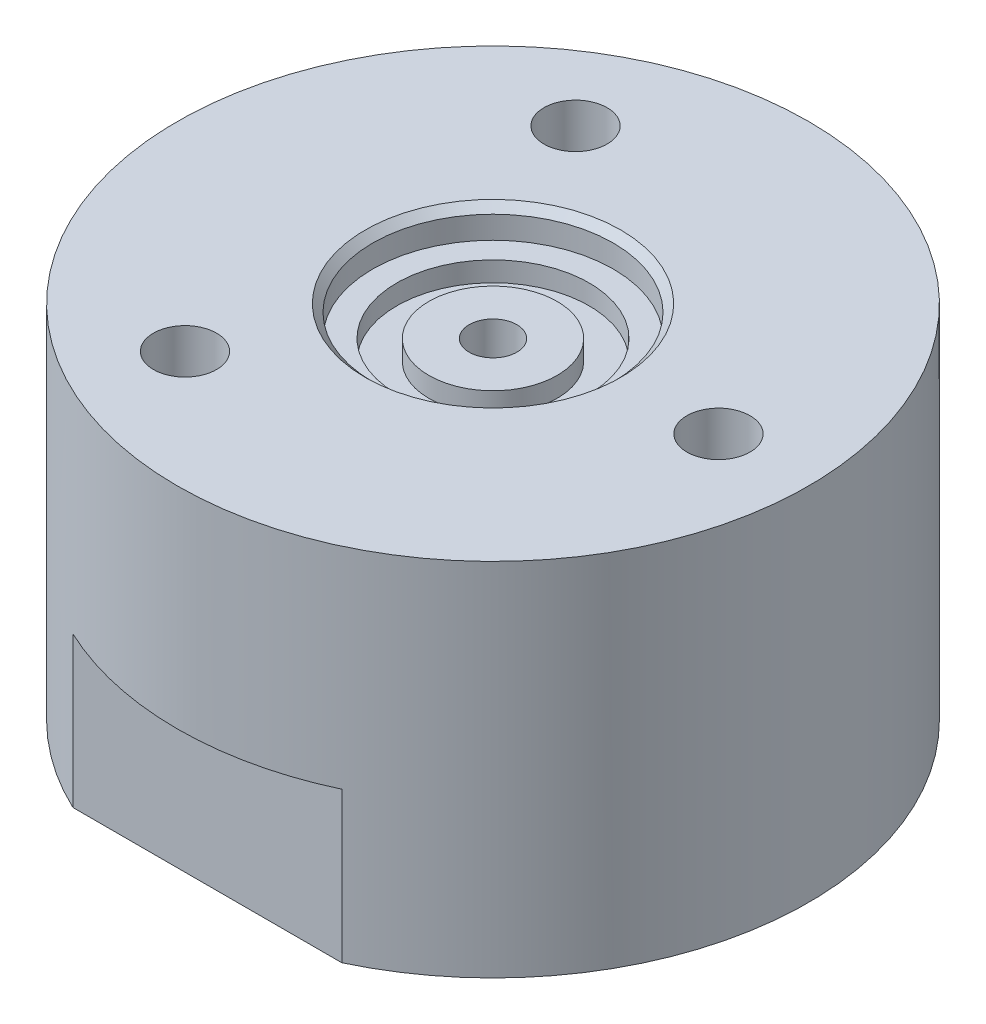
ISO-10303-21;
HEADER;
FILE_DESCRIPTION(('STEP AP214'),'2;1');
FILE_NAME('part.step','',(''),(''),'','','');
FILE_SCHEMA(('AUTOMOTIVE_DESIGN { 1 0 10303 214 1 1 1 1 }'));
ENDSEC;
DATA;
#1=APPLICATION_CONTEXT('core data for automotive mechanical design processes');
#2=APPLICATION_PROTOCOL_DEFINITION('international standard','automotive_design',2000,#1);
#3=PRODUCT_CONTEXT('',#1,'mechanical');
#4=PRODUCT('Part','Part','',(#3));
#5=PRODUCT_RELATED_PRODUCT_CATEGORY('part','',(#4));
#6=PRODUCT_DEFINITION_FORMATION('','',#4);
#7=PRODUCT_DEFINITION_CONTEXT('part definition',#1,'design');
#8=PRODUCT_DEFINITION('design','',#6,#7);
#9=PRODUCT_DEFINITION_SHAPE('','',#8);
#10=(LENGTH_UNIT() NAMED_UNIT(*) SI_UNIT(.MILLI.,.METRE.));
#11=(NAMED_UNIT(*) PLANE_ANGLE_UNIT() SI_UNIT($,.RADIAN.));
#12=(NAMED_UNIT(*) SI_UNIT($,.STERADIAN.) SOLID_ANGLE_UNIT());
#13=UNCERTAINTY_MEASURE_WITH_UNIT(LENGTH_MEASURE(1.E-05),#10,'distance_accuracy_value','');
#14=(GEOMETRIC_REPRESENTATION_CONTEXT(3) GLOBAL_UNCERTAINTY_ASSIGNED_CONTEXT((#13)) GLOBAL_UNIT_ASSIGNED_CONTEXT((#10,
#11,#12)) REPRESENTATION_CONTEXT('',''));
#15=CARTESIAN_POINT('',(0.,0.,0.));
#16=DIRECTION('',(0.,0.,1.));
#17=DIRECTION('',(1.,0.,0.));
#18=AXIS2_PLACEMENT_3D('',#15,#16,#17);
#19=CARTESIAN_POINT('',(-21.,-7.5,0.));
#20=DIRECTION('',(-1.,0.,0.));
#21=DIRECTION('',(0.,0.,1.));
#22=AXIS2_PLACEMENT_3D('',#19,#20,#21);
#23=CYLINDRICAL_SURFACE('',#22,0.793749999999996);
#24=CARTESIAN_POINT('',(-1.37481532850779,-7.5,0.793749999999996));
#25=CARTESIAN_POINT('',(-1.37481893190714,-7.45863942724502,0.793747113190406));
#26=CARTESIAN_POINT('',(-1.37671017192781,-7.417226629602,0.790495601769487));
#27=CARTESIAN_POINT('',(-1.38400128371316,-7.33567210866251,0.777655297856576));
#28=CARTESIAN_POINT('',(-1.38940852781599,-7.29553324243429,0.768053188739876));
#29=CARTESIAN_POINT('',(-1.40294793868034,-7.217860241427,0.743029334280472));
#30=CARTESIAN_POINT('',(-1.41106559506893,-7.18031349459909,0.727638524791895));
#31=CARTESIAN_POINT('',(-1.4290886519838,-7.10834453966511,0.691568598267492));
#32=CARTESIAN_POINT('',(-1.43899414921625,-7.07392250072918,0.670889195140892));
#33=CARTESIAN_POINT('',(-1.46047514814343,-7.00604482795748,0.622829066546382));
#34=CARTESIAN_POINT('',(-1.47212100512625,-6.97290306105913,0.595036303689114));
#35=CARTESIAN_POINT('',(-1.49520261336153,-6.91150709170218,0.534395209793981));
#36=CARTESIAN_POINT('',(-1.50663825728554,-6.88325532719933,0.501544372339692));
#37=CARTESIAN_POINT('',(-1.52893297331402,-6.83057732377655,0.429013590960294));
#38=CARTESIAN_POINT('',(-1.53970121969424,-6.8065373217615,0.389022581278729));
#39=CARTESIAN_POINT('',(-1.55853412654,-6.76566944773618,0.304924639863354));
#40=CARTESIAN_POINT('',(-1.56660049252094,-6.74883702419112,0.260820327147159));
#41=CARTESIAN_POINT('',(-1.57861366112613,-6.72410567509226,0.173073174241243));
#42=CARTESIAN_POINT('',(-1.58281274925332,-6.7156563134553,0.129620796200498));
#43=CARTESIAN_POINT('',(-1.58756019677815,-6.70611814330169,0.0417279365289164));
#44=CARTESIAN_POINT('',(-1.58811076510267,-6.70502488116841,-0.00271193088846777));
#45=CARTESIAN_POINT('',(-1.58561866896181,-6.71001767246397,-0.0871795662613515));
#46=CARTESIAN_POINT('',(-1.58288431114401,-6.71548767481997,-0.127254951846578));
#47=CARTESIAN_POINT('',(-1.57459557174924,-6.73234916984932,-0.205830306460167));
#48=CARTESIAN_POINT('',(-1.56904097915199,-6.74374110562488,-0.244330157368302));
#49=CARTESIAN_POINT('',(-1.55552444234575,-6.77219678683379,-0.319333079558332));
#50=CARTESIAN_POINT('',(-1.54753025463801,-6.78933682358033,-0.355801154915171));
#51=CARTESIAN_POINT('',(-1.52985506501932,-6.82869658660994,-0.425431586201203));
#52=CARTESIAN_POINT('',(-1.52017345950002,-6.85091813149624,-0.458592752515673));
#53=CARTESIAN_POINT('',(-1.49895238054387,-6.90222318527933,-0.52401284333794));
#54=CARTESIAN_POINT('',(-1.48732379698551,-6.93175677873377,-0.555890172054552));
#55=CARTESIAN_POINT('',(-1.46410632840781,-6.99564309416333,-0.61444534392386));
#56=CARTESIAN_POINT('',(-1.45251748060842,-7.02999948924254,-0.641119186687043));
#57=CARTESIAN_POINT('',(-1.42989423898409,-7.10522700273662,-0.690169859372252));
#58=CARTESIAN_POINT('',(-1.41894178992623,-7.14637328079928,-0.712166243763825));
#59=CARTESIAN_POINT('',(-1.39998013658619,-7.23245677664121,-0.748759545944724));
#60=CARTESIAN_POINT('',(-1.39196786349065,-7.27738998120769,-0.76336418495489));
#61=CARTESIAN_POINT('',(-1.3806855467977,-7.36602651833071,-0.783574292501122));
#62=CARTESIAN_POINT('',(-1.37709001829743,-7.40954513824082,-0.789801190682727));
#63=CARTESIAN_POINT('',(-1.37412348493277,-7.49714356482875,-0.794954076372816));
#64=CARTESIAN_POINT('',(-1.3747494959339,-7.54122295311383,-0.793885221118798));
#65=CARTESIAN_POINT('',(-1.37981004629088,-7.62355029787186,-0.78504735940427));
#66=CARTESIAN_POINT('',(-1.38382047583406,-7.66190868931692,-0.778024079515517));
#67=CARTESIAN_POINT('',(-1.39457129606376,-7.73682943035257,-0.758583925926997));
#68=CARTESIAN_POINT('',(-1.40131257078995,-7.77339119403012,-0.74616530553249));
#69=CARTESIAN_POINT('',(-1.41713126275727,-7.84560774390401,-0.715682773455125));
#70=CARTESIAN_POINT('',(-1.42630241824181,-7.8811420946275,-0.697384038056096));
#71=CARTESIAN_POINT('',(-1.44586419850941,-7.94884123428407,-0.655865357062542));
#72=CARTESIAN_POINT('',(-1.45625544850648,-7.98100427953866,-0.632642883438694));
#73=CARTESIAN_POINT('',(-1.47866098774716,-8.04528939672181,-0.578514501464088));
#74=CARTESIAN_POINT('',(-1.49071475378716,-8.07689523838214,-0.547009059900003));
#75=CARTESIAN_POINT('',(-1.51395299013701,-8.13453346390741,-0.47895231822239));
#76=CARTESIAN_POINT('',(-1.52513716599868,-8.16056396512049,-0.44239932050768));
#77=CARTESIAN_POINT('',(-1.54575955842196,-8.20689289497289,-0.363962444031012));
#78=CARTESIAN_POINT('',(-1.55514390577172,-8.22702191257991,-0.321963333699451));
#79=CARTESIAN_POINT('',(-1.57069912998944,-8.2597282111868,-0.234570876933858));
#80=CARTESIAN_POINT('',(-1.5768728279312,-8.272312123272,-0.189180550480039));
#81=CARTESIAN_POINT('',(-1.58486084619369,-8.28848629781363,-0.100790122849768));
#82=CARTESIAN_POINT('',(-1.58702317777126,-8.29279581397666,-0.0579528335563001));
#83=CARTESIAN_POINT('',(-1.58783440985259,-8.29441934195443,0.0278812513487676));
#84=CARTESIAN_POINT('',(-1.58648454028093,-8.29173580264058,0.0708779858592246));
#85=CARTESIAN_POINT('',(-1.580625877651,-8.27992572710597,0.152827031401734));
#86=CARTESIAN_POINT('',(-1.57633110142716,-8.27123540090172,0.191859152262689));
#87=CARTESIAN_POINT('',(-1.56521224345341,-8.24824669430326,0.267847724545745));
#88=CARTESIAN_POINT('',(-1.55838779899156,-8.23394750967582,0.304803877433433));
#89=CARTESIAN_POINT('',(-1.54246207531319,-8.19951040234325,0.377367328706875));
#90=CARTESIAN_POINT('',(-1.53327589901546,-8.17914891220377,0.412849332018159));
#91=CARTESIAN_POINT('',(-1.51358705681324,-8.13344589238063,0.48003987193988));
#92=CARTESIAN_POINT('',(-1.50308378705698,-8.10810207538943,0.51174666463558));
#93=CARTESIAN_POINT('',(-1.48057084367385,-8.05022977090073,0.57381299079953));
#94=CARTESIAN_POINT('',(-1.46851527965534,-8.01723727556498,0.603724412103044));
#95=CARTESIAN_POINT('',(-1.44512566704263,-7.94652349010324,0.65775148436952));
#96=CARTESIAN_POINT('',(-1.4337922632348,-7.90879806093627,0.681862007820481));
#97=CARTESIAN_POINT('',(-1.41287186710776,-7.82810716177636,0.72424216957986));
#98=CARTESIAN_POINT('',(-1.40335138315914,-7.78501377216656,0.742303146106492));
#99=CARTESIAN_POINT('',(-1.38800011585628,-7.6957924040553,0.770634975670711));
#100=CARTESIAN_POINT('',(-1.38215700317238,-7.64967514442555,0.780931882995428));
#101=CARTESIAN_POINT('',(-1.3773886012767,-7.58587949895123,0.789278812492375));
#102=CARTESIAN_POINT('',(-1.37642702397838,-7.56876423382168,0.790952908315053));
#103=CARTESIAN_POINT('',(-1.37513961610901,-7.53443566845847,0.793189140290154));
#104=CARTESIAN_POINT('',(-1.37481382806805,-7.51722236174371,0.793751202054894));
#105=CARTESIAN_POINT('',(-1.37481532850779,-7.5,0.793749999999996));
#106=B_SPLINE_CURVE_WITH_KNOTS('',3,(#24,#25,#26,#27,#28,#29,#30,#31,#32,#33,#34,#35,#36,#37,
#38,#39,#40,#41,#42,#43,#44,#45,#46,#47,#48,#49,#50,#51,#52,#53,#54,#55,#56,#57,#58,#59,#60,#61,
#62,#63,#64,#65,#66,#67,#68,#69,#70,#71,#72,#73,#74,#75,#76,#77,#78,#79,#80,#81,#82,#83,#84,#85,
#86,#87,#88,#89,#90,#91,#92,#93,#94,#95,#96,#97,#98,#99,#100,#101,#102,#103,#104,#105),
.UNSPECIFIED.,.T.,.F.,(4,2,2,2,2,2,2,2,2,2,2,2,2,2,2,2,2,2,2,2,2,2,2,2,2,2,2,2,2,2,2,2,2,2,2,2,
2,2,2,2,4),(0.,0.124009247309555,0.248279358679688,0.371894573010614,0.495516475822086,
0.629334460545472,0.763218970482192,0.906128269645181,1.04894718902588,1.18160391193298,
1.31418031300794,1.43522777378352,1.55628429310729,1.67901568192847,1.80179106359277,
1.93617208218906,2.07065600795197,2.21368018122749,2.3565546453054,2.48810693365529,
2.6195662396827,2.73664508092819,2.85376185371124,2.97630291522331,3.09890704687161,
3.2369660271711,3.37507155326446,3.5168219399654,3.65844756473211,3.78707864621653,
3.91566468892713,4.03577762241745,4.15590778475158,4.28117595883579,4.40650177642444,
4.54430004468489,4.68221967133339,4.8244978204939,4.96629636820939,5.01792982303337,
5.06956673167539),.UNSPECIFIED.);
#107=CARTESIAN_POINT('',(-1.37481532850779,-7.5,0.793749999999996));
#108=VERTEX_POINT('',#107);
#109=EDGE_CURVE('E139',#108,#108,#106,.T.);
#110=ORIENTED_EDGE('',*,*,#109,.F.);
#111=EDGE_LOOP('',(#110));
#112=FACE_BOUND('',#111,.T.);
#113=CARTESIAN_POINT('',(-10.586,-7.5,0.));
#114=DIRECTION('',(-1.,0.,0.));
#115=DIRECTION('',(0.,0.,1.));
#116=AXIS2_PLACEMENT_3D('',#113,#114,#115);
#117=CIRCLE('',#116,0.793749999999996);
#118=CARTESIAN_POINT('',(-10.586,-7.5,0.793749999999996));
#119=VERTEX_POINT('',#118);
#120=EDGE_CURVE('E140',#119,#119,#117,.F.);
#121=ORIENTED_EDGE('',*,*,#120,.F.);
#122=EDGE_LOOP('',(#121));
#123=FACE_BOUND('',#122,.T.);
#124=ADVANCED_FACE('F47',(#112,#123),#23,.F.);
#125=CARTESIAN_POINT('',(-14.7008,-7.5,0.));
#126=DIRECTION('',(-1.,0.,0.));
#127=DIRECTION('',(0.,0.,1.));
#128=AXIS2_PLACEMENT_3D('',#125,#126,#127);
#129=CONICAL_SURFACE('',#128,2.0193,1.02974425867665);
#130=CARTESIAN_POINT('',(-14.7008,-7.5,0.));
#131=DIRECTION('',(-1.,0.,0.));
#132=DIRECTION('',(0.,0.,1.));
#133=AXIS2_PLACEMENT_3D('',#130,#131,#132);
#134=CIRCLE('',#133,2.0193);
#135=CARTESIAN_POINT('',(-14.7008,-7.5,2.0193));
#136=VERTEX_POINT('',#135);
#137=EDGE_CURVE('E136',#136,#136,#134,.T.);
#138=ORIENTED_EDGE('',*,*,#137,.T.);
#139=EDGE_LOOP('',(#138));
#140=FACE_BOUND('',#139,.T.);
#141=CARTESIAN_POINT('',(-14.4697614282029,-7.5,0.));
#142=DIRECTION('',(1.,0.,0.));
#143=DIRECTION('',(0.,0.,-1.));
#144=AXIS2_PLACEMENT_3D('',#141,#142,#143);
#145=CIRCLE('',#144,1.63478724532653);
#146=CARTESIAN_POINT('',(-14.4697614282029,-7.5,-1.63478724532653));
#147=VERTEX_POINT('',#146);
#148=EDGE_CURVE('E135',#147,#147,#145,.F.);
#149=ORIENTED_EDGE('',*,*,#148,.F.);
#150=EDGE_LOOP('',(#149));
#151=FACE_BOUND('',#150,.T.);
#152=ADVANCED_FACE('F158',(#140,#151),#129,.F.);
#153=CARTESIAN_POINT('',(0.,-2.,0.));
#154=DIRECTION('',(0.,1.,0.));
#155=DIRECTION('',(0.,0.,1.));
#156=AXIS2_PLACEMENT_3D('',#153,#154,#155);
#157=PLANE('',#156);
#158=CARTESIAN_POINT('',(0.,-2.,0.));
#159=DIRECTION('',(0.,1.,0.));
#160=DIRECTION('',(0.,0.,1.));
#161=AXIS2_PLACEMENT_3D('',#158,#159,#160);
#162=CIRCLE('',#161,4.2672);
#163=CARTESIAN_POINT('',(0.,-2.,4.2672));
#164=VERTEX_POINT('',#163);
#165=EDGE_CURVE('E501',#164,#164,#162,.T.);
#166=ORIENTED_EDGE('',*,*,#165,.T.);
#167=EDGE_LOOP('',(#166));
#168=FACE_BOUND('',#167,.T.);
#169=CARTESIAN_POINT('',(0.,-2.,0.));
#170=DIRECTION('',(0.,1.,0.));
#171=DIRECTION('',(0.,0.,1.));
#172=AXIS2_PLACEMENT_3D('',#169,#170,#171);
#173=CIRCLE('',#172,1.58749999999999);
#174=CARTESIAN_POINT('',(0.,-2.,1.58749999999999));
#175=VERTEX_POINT('',#174);
#176=EDGE_CURVE('E237',#175,#175,#173,.F.);
#177=ORIENTED_EDGE('',*,*,#176,.T.);
#178=EDGE_LOOP('',(#177));
#179=FACE_BOUND('',#178,.T.);
#180=ADVANCED_FACE('F188',(#168,#179),#157,.T.);
#181=CARTESIAN_POINT('',(0.,0.,0.));
#182=DIRECTION('',(0.,1.,0.));
#183=DIRECTION('',(0.,0.,1.));
#184=AXIS2_PLACEMENT_3D('',#181,#182,#183);
#185=CYLINDRICAL_SURFACE('',#184,1.58749999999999);
#186=ORIENTED_EDGE('',*,*,#109,.T.);
#187=EDGE_LOOP('',(#186));
#188=FACE_BOUND('',#187,.T.);
#189=CARTESIAN_POINT('',(0.,-13.4,0.));
#190=DIRECTION('',(0.,1.,0.));
#191=DIRECTION('',(0.,0.,1.));
#192=AXIS2_PLACEMENT_3D('',#189,#190,#191);
#193=CIRCLE('',#192,1.58749999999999);
#194=CARTESIAN_POINT('',(0.,-13.4,1.58749999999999));
#195=VERTEX_POINT('',#194);
#196=EDGE_CURVE('E242',#195,#195,#193,.F.);
#197=ORIENTED_EDGE('',*,*,#196,.T.);
#198=EDGE_LOOP('',(#197));
#199=FACE_BOUND('',#198,.T.);
#200=ORIENTED_EDGE('',*,*,#176,.F.);
#201=EDGE_LOOP('',(#200));
#202=FACE_BOUND('',#201,.T.);
#203=ADVANCED_FACE('F150',(#188,#199,#202),#185,.F.);
#204=CARTESIAN_POINT('',(0.,-24.,0.));
#205=DIRECTION('',(0.,1.,0.));
#206=DIRECTION('',(0.,0.,1.));
#207=AXIS2_PLACEMENT_3D('',#204,#205,#206);
#208=CYLINDRICAL_SURFACE('',#207,21.);
#209=DIRECTION('',(0.,-1.,0.));
#210=VECTOR('',#209,1.);
#211=CARTESIAN_POINT('',(8.94427190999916,-14.,-19.));
#212=LINE('',#211,#210);
#213=CARTESIAN_POINT('',(8.94427190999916,-14.,-19.));
#214=VERTEX_POINT('',#213);
#215=CARTESIAN_POINT('',(8.94427190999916,-24.,-19.));
#216=VERTEX_POINT('',#215);
#217=EDGE_CURVE('E70',#214,#216,#212,.T.);
#218=ORIENTED_EDGE('',*,*,#217,.F.);
#219=CARTESIAN_POINT('',(0.,-14.,0.));
#220=DIRECTION('',(0.,-1.,0.));
#221=DIRECTION('',(0.,0.,-1.));
#222=AXIS2_PLACEMENT_3D('',#219,#220,#221);
#223=CIRCLE('',#222,21.);
#224=CARTESIAN_POINT('',(-8.94427190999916,-14.,-19.));
#225=VERTEX_POINT('',#224);
#226=EDGE_CURVE('E99',#225,#214,#223,.T.);
#227=ORIENTED_EDGE('',*,*,#226,.F.);
#228=DIRECTION('',(0.,-1.,0.));
#229=VECTOR('',#228,1.);
#230=CARTESIAN_POINT('',(-8.94427190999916,-14.,-19.));
#231=LINE('',#230,#229);
#232=CARTESIAN_POINT('',(-8.94427190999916,-24.,-19.));
#233=VERTEX_POINT('',#232);
#234=EDGE_CURVE('E107',#225,#233,#231,.T.);
#235=ORIENTED_EDGE('',*,*,#234,.T.);
#236=CARTESIAN_POINT('',(0.,-24.,0.));
#237=DIRECTION('',(0.,1.,0.));
#238=DIRECTION('',(0.,0.,1.));
#239=AXIS2_PLACEMENT_3D('',#236,#237,#238);
#240=CIRCLE('',#239,21.);
#241=CARTESIAN_POINT('',(-8.94427190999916,-24.,19.));
#242=VERTEX_POINT('',#241);
#243=EDGE_CURVE('E228',#233,#242,#240,.T.);
#244=ORIENTED_EDGE('',*,*,#243,.T.);
#245=DIRECTION('',(0.,-1.,0.));
#246=VECTOR('',#245,1.);
#247=CARTESIAN_POINT('',(-8.94427190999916,-14.,19.));
#248=LINE('',#247,#246);
#249=CARTESIAN_POINT('',(-8.94427190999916,-14.,19.));
#250=VERTEX_POINT('',#249);
#251=EDGE_CURVE('E62',#250,#242,#248,.T.);
#252=ORIENTED_EDGE('',*,*,#251,.F.);
#253=CARTESIAN_POINT('',(0.,-14.,0.));
#254=DIRECTION('',(0.,-1.,0.));
#255=DIRECTION('',(0.,0.,-1.));
#256=AXIS2_PLACEMENT_3D('',#253,#254,#255);
#257=CIRCLE('',#256,21.);
#258=CARTESIAN_POINT('',(8.94427190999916,-14.,19.));
#259=VERTEX_POINT('',#258);
#260=EDGE_CURVE('E120',#259,#250,#257,.T.);
#261=ORIENTED_EDGE('',*,*,#260,.F.);
#262=DIRECTION('',(0.,-1.,0.));
#263=VECTOR('',#262,1.);
#264=CARTESIAN_POINT('',(8.94427190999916,-14.,19.));
#265=LINE('',#264,#263);
#266=CARTESIAN_POINT('',(8.94427190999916,-24.,19.));
#267=VERTEX_POINT('',#266);
#268=EDGE_CURVE('E127',#259,#267,#265,.T.);
#269=ORIENTED_EDGE('',*,*,#268,.T.);
#270=EDGE_CURVE('E114',#267,#216,#240,.T.);
#271=ORIENTED_EDGE('',*,*,#270,.T.);
#272=EDGE_LOOP('',(#218,#227,#235,#244,#252,#261,#269,#271));
#273=FACE_BOUND('',#272,.T.);
#274=CARTESIAN_POINT('',(-20.8484455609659,-7.5,2.51839585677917));
#275=CARTESIAN_POINT('',(-20.8484455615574,-7.4183735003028,2.5183958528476));
#276=CARTESIAN_POINT('',(-20.8489441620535,-7.33746545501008,2.51427795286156));
#277=CARTESIAN_POINT('',(-20.8508890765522,-7.17696218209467,2.49809751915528));
#278=CARTESIAN_POINT('',(-20.8523355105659,-7.09737961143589,2.48603383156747));
#279=CARTESIAN_POINT('',(-20.8561281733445,-6.93954287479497,2.45401243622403));
#280=CARTESIAN_POINT('',(-20.8584758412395,-6.86126983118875,2.43404286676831));
#281=CARTESIAN_POINT('',(-20.8626316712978,-6.74493441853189,2.39807157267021));
#282=CARTESIAN_POINT('',(-20.8641267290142,-6.70625714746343,2.38503976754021));
#283=CARTESIAN_POINT('',(-20.8673118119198,-6.62950998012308,2.35701013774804));
#284=CARTESIAN_POINT('',(-20.868991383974,-6.59168386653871,2.34210408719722));
#285=CARTESIAN_POINT('',(-20.8725148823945,-6.5169585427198,2.31049245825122));
#286=CARTESIAN_POINT('',(-20.8743577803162,-6.48008381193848,2.29379594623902));
#287=CARTESIAN_POINT('',(-20.8781903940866,-6.40729645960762,2.25864526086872));
#288=CARTESIAN_POINT('',(-20.8801801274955,-6.37138388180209,2.24019100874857));
#289=CARTESIAN_POINT('',(-20.8863467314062,-6.26507929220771,2.18220785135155));
#290=CARTESIAN_POINT('',(-20.8907219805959,-6.19610695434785,2.14005593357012));
#291=CARTESIAN_POINT('',(-20.8975864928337,-6.09556321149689,2.07157084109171));
#292=CARTESIAN_POINT('',(-20.8999270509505,-6.0625083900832,2.04784243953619));
#293=CARTESIAN_POINT('',(-20.9046896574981,-5.99743217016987,1.99864021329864));
#294=CARTESIAN_POINT('',(-20.9071209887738,-5.96529244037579,1.97306655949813));
#295=CARTESIAN_POINT('',(-20.9120225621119,-5.90240864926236,1.92041936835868));
#296=CARTESIAN_POINT('',(-20.9144849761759,-5.8717560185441,1.89343344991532));
#297=CARTESIAN_POINT('',(-20.9194221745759,-5.81190800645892,1.83808266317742));
#298=CARTESIAN_POINT('',(-20.9218957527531,-5.78272790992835,1.80973108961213));
#299=CARTESIAN_POINT('',(-20.9293047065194,-5.69739103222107,1.72267147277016));
#300=CARTESIAN_POINT('',(-20.9342284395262,-5.64343294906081,1.66196283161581));
#301=CARTESIAN_POINT('',(-20.9414858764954,-5.56688158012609,1.56690098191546));
#302=CARTESIAN_POINT('',(-20.9438837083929,-5.54209662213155,1.53454612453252));
#303=CARTESIAN_POINT('',(-20.9486190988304,-5.49400507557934,1.46848709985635));
#304=CARTESIAN_POINT('',(-20.9509577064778,-5.47068869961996,1.43476605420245));
#305=CARTESIAN_POINT('',(-20.9555526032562,-5.42559802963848,1.36601841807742));
#306=CARTESIAN_POINT('',(-20.9578188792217,-5.40372955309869,1.330826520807));
#307=CARTESIAN_POINT('',(-20.9622112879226,-5.36194348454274,1.25974692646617));
#308=CARTESIAN_POINT('',(-20.9643415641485,-5.34198220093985,1.22380833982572));
#309=CARTESIAN_POINT('',(-20.9684567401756,-5.30389832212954,1.15114984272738));
#310=CARTESIAN_POINT('',(-20.970441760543,-5.28577435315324,1.11442945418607));
#311=CARTESIAN_POINT('',(-20.9742541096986,-5.25134304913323,1.04021398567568));
#312=CARTESIAN_POINT('',(-20.9760814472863,-5.23503574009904,1.00271889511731));
#313=CARTESIAN_POINT('',(-20.9795660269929,-5.20423186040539,0.926955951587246));
#314=CARTESIAN_POINT('',(-20.9812232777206,-5.18973528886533,0.888688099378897));
#315=CARTESIAN_POINT('',(-20.9843552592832,-5.16256007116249,0.811376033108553));
#316=CARTESIAN_POINT('',(-20.9858299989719,-5.14988139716,0.772331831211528));
#317=CARTESIAN_POINT('',(-20.9885843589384,-5.12636249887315,0.693457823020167));
#318=CARTESIAN_POINT('',(-20.9898639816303,-5.11552231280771,0.653623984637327));
#319=CARTESIAN_POINT('',(-20.9922151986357,-5.09571462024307,0.573171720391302));
#320=CARTESIAN_POINT('',(-20.993287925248,-5.08673798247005,0.532464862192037));
#321=CARTESIAN_POINT('',(-20.9951908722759,-5.07088198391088,0.4512262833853));
#322=CARTESIAN_POINT('',(-20.996026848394,-5.06395401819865,0.410509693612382));
#323=CARTESIAN_POINT('',(-20.9974623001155,-5.0520936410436,0.328996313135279));
#324=CARTESIAN_POINT('',(-20.9980623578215,-5.04715644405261,0.288180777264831));
#325=CARTESIAN_POINT('',(-20.9995065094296,-5.03529495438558,0.165559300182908));
#326=CARTESIAN_POINT('',(-20.9999946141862,-5.03131436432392,0.0835788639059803));
#327=CARTESIAN_POINT('',(-21.0000026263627,-5.03124904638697,-0.0397419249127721));
#328=CARTESIAN_POINT('',(-20.9998846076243,-5.03221310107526,-0.0809073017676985));
#329=CARTESIAN_POINT('',(-20.9994050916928,-5.03613731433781,-0.163356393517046));
#330=CARTESIAN_POINT('',(-20.9990437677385,-5.03909596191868,-0.204620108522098));
#331=CARTESIAN_POINT('',(-20.9980747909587,-5.04705404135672,-0.287348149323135));
#332=CARTESIAN_POINT('',(-20.9974675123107,-5.05205061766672,-0.328691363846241));
#333=CARTESIAN_POINT('',(-20.9960262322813,-5.06395906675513,-0.410553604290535));
#334=CARTESIAN_POINT('',(-20.9951904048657,-5.07088598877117,-0.451235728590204));
#335=CARTESIAN_POINT('',(-20.992354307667,-5.09451697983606,-0.572342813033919));
#336=CARTESIAN_POINT('',(-20.9900236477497,-5.11407963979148,-0.651979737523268));
#337=CARTESIAN_POINT('',(-20.9859249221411,-5.14906756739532,-0.769738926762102));
#338=CARTESIAN_POINT('',(-20.9844581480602,-5.16167282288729,-0.808712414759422));
#339=CARTESIAN_POINT('',(-20.9813329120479,-5.18877890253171,-0.886097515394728));
#340=CARTESIAN_POINT('',(-20.9796744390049,-5.20327964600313,-0.924509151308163));
#341=CARTESIAN_POINT('',(-20.9761752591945,-5.23420063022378,-1.00076384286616));
#342=CARTESIAN_POINT('',(-20.9743357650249,-5.25060988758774,-1.03858290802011));
#343=CARTESIAN_POINT('',(-20.9704793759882,-5.28543044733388,-1.11373741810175));
#344=CARTESIAN_POINT('',(-20.9684745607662,-5.30373391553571,-1.15083409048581));
#345=CARTESIAN_POINT('',(-20.962285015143,-5.36101350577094,-1.26012140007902));
#346=CARTESIAN_POINT('',(-20.9579115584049,-5.40247211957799,-1.33064304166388));
#347=CARTESIAN_POINT('',(-20.948808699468,-5.49175489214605,-1.46699832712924));
#348=CARTESIAN_POINT('',(-20.9440783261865,-5.53958419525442,-1.53285383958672));
#349=CARTESIAN_POINT('',(-20.9343924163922,-5.64165722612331,-1.6599017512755));
#350=CARTESIAN_POINT('',(-20.9294377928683,-5.69588657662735,-1.72108101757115));
#351=CARTESIAN_POINT('',(-20.9194348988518,-5.8110441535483,-1.83867380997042));
#352=CARTESIAN_POINT('',(-20.9144712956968,-5.87101535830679,-1.8941043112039));
#353=CARTESIAN_POINT('',(-20.9047652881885,-5.9954923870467,-1.99838223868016));
#354=CARTESIAN_POINT('',(-20.9000212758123,-6.06001444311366,-2.04724464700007));
#355=CARTESIAN_POINT('',(-20.8908854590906,-6.19360312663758,-2.13845891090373));
#356=CARTESIAN_POINT('',(-20.8864925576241,-6.26269323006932,-2.1808172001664));
#357=CARTESIAN_POINT('',(-20.8802713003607,-6.36975056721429,-2.23934311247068));
#358=CARTESIAN_POINT('',(-20.8782558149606,-6.40608141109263,-2.25804231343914));
#359=CARTESIAN_POINT('',(-20.8743747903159,-6.47973394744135,-2.2936428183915));
#360=CARTESIAN_POINT('',(-20.872522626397,-6.51680036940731,-2.31042252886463));
#361=CARTESIAN_POINT('',(-20.8689980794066,-6.5915358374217,-2.34204446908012));
#362=CARTESIAN_POINT('',(-20.8673268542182,-6.62918268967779,-2.3568760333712));
#363=CARTESIAN_POINT('',(-20.8641763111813,-6.70502796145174,-2.38460512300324));
#364=CARTESIAN_POINT('',(-20.8626969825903,-6.74322640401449,-2.39750256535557));
#365=CARTESIAN_POINT('',(-20.8585613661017,-6.8586450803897,-2.43330968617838));
#366=CARTESIAN_POINT('',(-20.8562071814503,-6.93669876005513,-2.45334193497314));
#367=CARTESIAN_POINT('',(-20.8533389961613,-7.05540699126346,-2.47756305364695));
#368=CARTESIAN_POINT('',(-20.8524930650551,-7.09527906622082,-2.48466714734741));
#369=CARTESIAN_POINT('',(-20.8510327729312,-7.17552405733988,-2.49689211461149));
#370=CARTESIAN_POINT('',(-20.8504168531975,-7.21603120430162,-2.50202601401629));
#371=CARTESIAN_POINT('',(-20.8494312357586,-7.29717246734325,-2.5102259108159));
#372=CARTESIAN_POINT('',(-20.8490618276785,-7.33771076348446,-2.51328970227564));
#373=CARTESIAN_POINT('',(-20.8485689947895,-7.41881879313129,-2.51737464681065));
#374=CARTESIAN_POINT('',(-20.8484457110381,-7.45937250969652,-2.5183946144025));
#375=CARTESIAN_POINT('',(-20.8484454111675,-7.54047934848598,-2.51839709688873));
#376=CARTESIAN_POINT('',(-20.8485683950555,-7.58103247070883,-2.51737961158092));
#377=CARTESIAN_POINT('',(-20.8490606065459,-7.66213811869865,-2.51329983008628));
#378=CARTESIAN_POINT('',(-20.8494297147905,-7.70267599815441,-2.51023853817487));
#379=CARTESIAN_POINT('',(-20.8504146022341,-7.78380973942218,-2.50204476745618));
#380=CARTESIAN_POINT('',(-20.8510303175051,-7.82432487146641,-2.496912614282));
#381=CARTESIAN_POINT('',(-20.8524900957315,-7.90457381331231,-2.48469206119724));
#382=CARTESIAN_POINT('',(-20.8533357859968,-7.94444856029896,-2.47759006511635));
#383=CARTESIAN_POINT('',(-20.8562030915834,-8.06315504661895,-2.45337666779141));
#384=CARTESIAN_POINT('',(-20.8585565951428,-8.14120459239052,-2.43335049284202));
#385=CARTESIAN_POINT('',(-20.8626907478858,-8.25660815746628,-2.39755679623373));
#386=CARTESIAN_POINT('',(-20.8641695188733,-8.29480036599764,-2.3846645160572));
#387=CARTESIAN_POINT('',(-20.8673187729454,-8.37063088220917,-2.35694754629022));
#388=CARTESIAN_POINT('',(-20.8689892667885,-8.40826921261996,-2.34212293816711));
#389=CARTESIAN_POINT('',(-20.8725121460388,-8.4829854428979,-2.31051715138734));
#390=CARTESIAN_POINT('',(-20.8743633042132,-8.52003962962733,-2.2937472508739));
#391=CARTESIAN_POINT('',(-20.8782423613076,-8.59367166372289,-2.25816664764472));
#392=CARTESIAN_POINT('',(-20.8802588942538,-8.63002955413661,-2.23945879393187));
#393=CARTESIAN_POINT('',(-20.8864811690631,-8.73712342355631,-2.18092637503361));
#394=CARTESIAN_POINT('',(-20.8908739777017,-8.80622047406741,-2.13857090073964));
#395=CARTESIAN_POINT('',(-20.9000087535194,-8.939810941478,-2.04737230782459));
#396=CARTESIAN_POINT('',(-20.9047516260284,-9.00432458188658,-1.99852454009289));
#397=CARTESIAN_POINT('',(-20.9144540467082,-9.12877122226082,-1.89429409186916));
#398=CARTESIAN_POINT('',(-20.9194120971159,-9.1886846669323,-1.83893287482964));
#399=CARTESIAN_POINT('',(-20.9294148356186,-9.30385775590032,-1.72135985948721));
#400=CARTESIAN_POINT('',(-20.9343752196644,-9.3581573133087,-1.66011933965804));
#401=CARTESIAN_POINT('',(-20.9440649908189,-9.46027949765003,-1.53303670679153));
#402=CARTESIAN_POINT('',(-20.9487967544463,-9.50812558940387,-1.46716906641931));
#403=CARTESIAN_POINT('',(-20.9579012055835,-9.59742869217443,-1.33080628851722));
#404=CARTESIAN_POINT('',(-20.9622750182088,-9.63889231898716,-1.26028681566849));
#405=CARTESIAN_POINT('',(-20.9684641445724,-9.69617052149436,-1.15102357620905));
#406=CARTESIAN_POINT('',(-20.9704682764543,-9.71446859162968,-1.11394648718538));
#407=CARTESIAN_POINT('',(-20.9743260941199,-9.74930352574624,-1.03877857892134));
#408=CARTESIAN_POINT('',(-20.976166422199,-9.7657207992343,-1.00094938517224));
#409=CARTESIAN_POINT('',(-20.9796670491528,-9.79665553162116,-0.924677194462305));
#410=CARTESIAN_POINT('',(-20.9813262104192,-9.81116266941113,-0.886256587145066));
#411=CARTESIAN_POINT('',(-20.9844527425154,-9.83828059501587,-0.80885310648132));
#412=CARTESIAN_POINT('',(-20.9859201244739,-9.85089130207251,-0.769870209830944));
#413=CARTESIAN_POINT('',(-20.9900205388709,-9.88589417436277,-0.652082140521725));
#414=CARTESIAN_POINT('',(-20.9923521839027,-9.90546524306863,-0.572421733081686));
#415=CARTESIAN_POINT('',(-20.9951893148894,-9.92910496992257,-0.451288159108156));
#416=CARTESIAN_POINT('',(-20.9960254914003,-9.9360348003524,-0.410591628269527));
#417=CARTESIAN_POINT('',(-20.9974672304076,-9.94794706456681,-0.328711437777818));
#418=CARTESIAN_POINT('',(-20.9980747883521,-9.95294593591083,-0.287347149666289));
#419=CARTESIAN_POINT('',(-20.9990434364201,-9.96090131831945,-0.204649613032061));
#420=CARTESIAN_POINT('',(-20.9994048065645,-9.96386035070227,-0.163390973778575));
#421=CARTESIAN_POINT('',(-20.9998843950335,-9.96778516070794,-0.0809582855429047));
#422=CARTESIAN_POINT('',(-21.000002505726,-9.9687499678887,-0.0397998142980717));
#423=CARTESIAN_POINT('',(-20.9999948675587,-9.96868770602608,0.0835040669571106));
#424=CARTESIAN_POINT('',(-20.9995071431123,-9.96471022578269,0.165478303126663));
#425=CARTESIAN_POINT('',(-20.9980634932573,-9.95285289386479,0.288097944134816));
#426=CARTESIAN_POINT('',(-20.99746359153,-9.94791700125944,0.328914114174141));
#427=CARTESIAN_POINT('',(-20.9960283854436,-9.93605870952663,0.410431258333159));
#428=CARTESIAN_POINT('',(-20.9951925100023,-9.92913161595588,0.451150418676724));
#429=CARTESIAN_POINT('',(-20.9932896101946,-9.91327610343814,0.5323988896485));
#430=CARTESIAN_POINT('',(-20.9922168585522,-9.90429929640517,0.573110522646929));
#431=CARTESIAN_POINT('',(-20.9898663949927,-9.88449808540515,0.653545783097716));
#432=CARTESIAN_POINT('',(-20.9885870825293,-9.8736606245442,0.693374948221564));
#433=CARTESIAN_POINT('',(-20.985833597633,-9.85014946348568,0.77223365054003));
#434=CARTESIAN_POINT('',(-20.984359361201,-9.83747528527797,0.811269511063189));
#435=CARTESIAN_POINT('',(-20.9812285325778,-9.81031053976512,0.888563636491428));
#436=CARTESIAN_POINT('',(-20.9795719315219,-9.79581994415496,0.926821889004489));
#437=CARTESIAN_POINT('',(-20.9760888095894,-9.76502973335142,1.00256448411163));
#438=CARTESIAN_POINT('',(-20.9742622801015,-9.74873011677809,1.04004882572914));
#439=CARTESIAN_POINT('',(-20.9704517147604,-9.71431617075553,1.11424175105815));
#440=CARTESIAN_POINT('',(-20.9684676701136,-9.6962018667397,1.1509503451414));
#441=CARTESIAN_POINT('',(-20.9643546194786,-9.65813957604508,1.22358431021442));
#442=CARTESIAN_POINT('',(-20.962225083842,-9.63818628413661,1.2595165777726));
#443=CARTESIAN_POINT('',(-20.9578359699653,-9.59643450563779,1.33055702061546));
#444=CARTESIAN_POINT('',(-20.9555692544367,-9.57456367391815,1.36576344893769));
#445=CARTESIAN_POINT('',(-20.9509728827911,-9.52946190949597,1.43454476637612));
#446=CARTESIAN_POINT('',(-20.9486339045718,-9.50614351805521,1.4682760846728));
#447=CARTESIAN_POINT('',(-20.9438978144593,-9.45804839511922,1.53435379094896));
#448=CARTESIAN_POINT('',(-20.9414997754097,-9.43326308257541,1.56671529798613));
#449=CARTESIAN_POINT('',(-20.9342421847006,-9.3567159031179,1.66179001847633));
#450=CARTESIAN_POINT('',(-20.929318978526,-9.30276758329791,1.72249779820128));
#451=CARTESIAN_POINT('',(-20.921911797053,-9.21745975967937,1.80954553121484));
#452=CARTESIAN_POINT('',(-20.9194389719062,-9.18829174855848,1.83789137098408));
#453=CARTESIAN_POINT('',(-20.9145035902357,-9.12847345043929,1.8932277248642));
#454=CARTESIAN_POINT('',(-20.9120416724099,-9.09783093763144,1.92021090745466));
#455=CARTESIAN_POINT('',(-20.9071436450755,-9.03500377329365,1.97282638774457));
#456=CARTESIAN_POINT('',(-20.9047096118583,-9.00283505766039,1.99843179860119));
#457=CARTESIAN_POINT('',(-20.8999446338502,-8.93773723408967,2.04766303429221));
#458=CARTESIAN_POINT('',(-20.8976023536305,-8.90466415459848,2.07141112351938));
#459=CARTESIAN_POINT('',(-20.8907350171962,-8.80409381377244,2.13992881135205));
#460=CARTESIAN_POINT('',(-20.8863575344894,-8.73509704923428,2.18210470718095));
#461=CARTESIAN_POINT('',(-20.8801888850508,-8.62877201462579,2.24010944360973));
#462=CARTESIAN_POINT('',(-20.8781985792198,-8.59285394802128,2.2585696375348));
#463=CARTESIAN_POINT('',(-20.874365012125,-8.52005855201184,2.29373017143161));
#464=CARTESIAN_POINT('',(-20.8725217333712,-8.48318126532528,2.31043058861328));
#465=CARTESIAN_POINT('',(-20.8689976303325,-8.40845406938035,2.34204845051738));
#466=CARTESIAN_POINT('',(-20.8673178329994,-8.37062856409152,2.35695683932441));
#467=CARTESIAN_POINT('',(-20.864132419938,-8.29388649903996,2.384989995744));
#468=CARTESIAN_POINT('',(-20.862636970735,-8.25520633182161,2.39802548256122));
#469=CARTESIAN_POINT('',(-20.8584800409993,-8.13886279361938,2.43400695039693));
#470=CARTESIAN_POINT('',(-20.8561316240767,-8.06058215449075,2.4539831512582));
#471=CARTESIAN_POINT('',(-20.8523375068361,-7.90272201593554,2.48601712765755));
#472=CARTESIAN_POINT('',(-20.8508903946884,-7.82312414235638,2.4980865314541));
#473=CARTESIAN_POINT('',(-20.8489444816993,-7.66258335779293,2.51427531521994));
#474=CARTESIAN_POINT('',(-20.8484455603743,-7.5816264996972,2.51839586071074));
#475=CARTESIAN_POINT('',(-20.8484455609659,-7.5,2.51839585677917));
#476=B_SPLINE_CURVE_WITH_KNOTS('',3,(#274,#275,#276,#277,#278,#279,#280,#281,#282,#283,#284,
#285,#286,#287,#288,#289,#290,#291,#292,#293,#294,#295,#296,#297,#298,#299,#300,#301,#302,#303,
#304,#305,#306,#307,#308,#309,#310,#311,#312,#313,#314,#315,#316,#317,#318,#319,#320,#321,#322,
#323,#324,#325,#326,#327,#328,#329,#330,#331,#332,#333,#334,#335,#336,#337,#338,#339,#340,#341,
#342,#343,#344,#345,#346,#347,#348,#349,#350,#351,#352,#353,#354,#355,#356,#357,#358,#359,#360,
#361,#362,#363,#364,#365,#366,#367,#368,#369,#370,#371,#372,#373,#374,#375,#376,#377,#378,#379,
#380,#381,#382,#383,#384,#385,#386,#387,#388,#389,#390,#391,#392,#393,#394,#395,#396,#397,#398,
#399,#400,#401,#402,#403,#404,#405,#406,#407,#408,#409,#410,#411,#412,#413,#414,#415,#416,#417,
#418,#419,#420,#421,#422,#423,#424,#425,#426,#427,#428,#429,#430,#431,#432,#433,#434,#435,#436,
#437,#438,#439,#440,#441,#442,#443,#444,#445,#446,#447,#448,#449,#450,#451,#452,#453,#454,#455,
#456,#457,#458,#459,#460,#461,#462,#463,#464,#465,#466,#467,#468,#469,#470,#471,#472,#473,#474,
#475),.UNSPECIFIED.,.T.,.F.,(4,2,2,2,2,2,2,2,2,2,2,2,2,2,2,2,2,2,2,2,2,2,2,2,2,2,2,2,2,2,2,2,2,
2,2,2,2,2,2,2,2,2,2,2,2,2,2,2,2,2,2,2,2,2,2,2,2,2,2,2,2,2,2,2,2,2,2,2,2,2,2,2,2,2,2,2,2,2,2,2,2,
2,2,2,2,2,2,2,2,2,2,2,2,2,2,2,2,2,2,2,4),(-2.33863643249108E-06,0.000239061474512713,
0.000480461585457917,0.000721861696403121,0.000842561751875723,0.000963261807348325,
0.00108396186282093,0.00120466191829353,0.00144606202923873,0.00156676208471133,
0.00168746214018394,0.00180816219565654,0.00192886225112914,0.00217026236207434,
0.00229096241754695,0.00241166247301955,0.00253236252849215,0.00265306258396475,
0.00277376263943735,0.00289446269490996,0.00301516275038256,0.00313586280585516,
0.00325656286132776,0.00337726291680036,0.00349796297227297,0.00361866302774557,
0.00386006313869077,0.00398076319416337,0.00410146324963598,0.00422216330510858,
0.00434286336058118,0.00458426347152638,0.00470496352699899,0.00482566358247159,
0.00494636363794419,0.00506706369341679,0.005308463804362,0.0055498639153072,0.0057912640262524,
0.00603266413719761,0.00627406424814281,0.00651546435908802,0.00663616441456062,
0.00675686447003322,0.00687756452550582,0.00699826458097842,0.00723966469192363,
0.00736036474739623,0.00748106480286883,0.00760176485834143,0.00772246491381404,
0.00784316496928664,0.00796386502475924,0.00808456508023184,0.00820526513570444,
0.00844666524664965,0.00856736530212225,0.00868806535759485,0.00880876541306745,
0.00892946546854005,0.00917086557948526,0.00941226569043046,0.00965366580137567,
0.00989506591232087,0.0101364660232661,0.0103778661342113,0.0104985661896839,0.0106192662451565,
0.0107399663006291,0.0108606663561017,0.0111020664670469,0.0112227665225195,0.0113434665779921,
0.0114641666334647,0.0115848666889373,0.0118262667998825,0.0119469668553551,0.0120676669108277,
0.0121883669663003,0.0123090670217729,0.0124297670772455,0.0125504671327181,0.0126711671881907,
0.0127918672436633,0.0129125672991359,0.0130332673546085,0.0131539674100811,0.0132746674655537,
0.0135160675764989,0.0136367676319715,0.0137574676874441,0.0138781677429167,0.0139988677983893,
0.0142402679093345,0.0143609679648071,0.0144816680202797,0.0146023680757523,0.0147230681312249,
0.0149644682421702,0.0152058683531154,0.0154472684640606),.UNSPECIFIED.);
#477=CARTESIAN_POINT('',(-20.8484455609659,-7.5,2.51839585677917));
#478=VERTEX_POINT('',#477);
#479=EDGE_CURVE('E483',#478,#478,#476,.F.);
#480=ORIENTED_EDGE('',*,*,#479,.T.);
#481=EDGE_LOOP('',(#480));
#482=FACE_BOUND('',#481,.T.);
#483=CARTESIAN_POINT('',(0.,0.,0.));
#484=DIRECTION('',(0.,1.,0.));
#485=DIRECTION('',(0.,0.,1.));
#486=AXIS2_PLACEMENT_3D('',#483,#484,#485);
#487=CIRCLE('',#486,21.);
#488=CARTESIAN_POINT('',(0.,0.,21.));
#489=VERTEX_POINT('',#488);
#490=EDGE_CURVE('E224',#489,#489,#487,.T.);
#491=ORIENTED_EDGE('',*,*,#490,.F.);
#492=EDGE_LOOP('',(#491));
#493=FACE_BOUND('',#492,.T.);
#494=ADVANCED_FACE('F110',(#273,#482,#493),#208,.T.);
#495=CARTESIAN_POINT('',(0.,-24.,0.));
#496=DIRECTION('',(0.,1.,0.));
#497=DIRECTION('',(0.,0.,1.));
#498=AXIS2_PLACEMENT_3D('',#495,#496,#497);
#499=PLANE('',#498);
#500=CARTESIAN_POINT('',(0.,-24.,0.));
#501=DIRECTION('',(0.,-1.,0.));
#502=DIRECTION('',(0.,0.,-1.));
#503=AXIS2_PLACEMENT_3D('',#500,#501,#502);
#504=CIRCLE('',#503,9.24999999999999);
#505=CARTESIAN_POINT('',(0.,-24.,-9.24999999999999));
#506=VERTEX_POINT('',#505);
#507=EDGE_CURVE('E148',#506,#506,#504,.T.);
#508=ORIENTED_EDGE('',*,*,#507,.F.);
#509=EDGE_LOOP('',(#508));
#510=FACE_BOUND('',#509,.T.);
#511=ORIENTED_EDGE('',*,*,#243,.F.);
#512=DIRECTION('',(-1.,0.,0.));
#513=VECTOR('',#512,1.);
#514=CARTESIAN_POINT('',(8.94427190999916,-24.,-19.));
#515=LINE('',#514,#513);
#516=EDGE_CURVE('E104',#216,#233,#515,.T.);
#517=ORIENTED_EDGE('',*,*,#516,.F.);
#518=ORIENTED_EDGE('',*,*,#270,.F.);
#519=DIRECTION('',(1.,0.,0.));
#520=VECTOR('',#519,1.);
#521=CARTESIAN_POINT('',(8.94427190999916,-24.,19.));
#522=LINE('',#521,#520);
#523=EDGE_CURVE('E123',#242,#267,#522,.T.);
#524=ORIENTED_EDGE('',*,*,#523,.F.);
#525=EDGE_LOOP('',(#511,#517,#518,#524));
#526=FACE_BOUND('',#525,.T.);
#527=ADVANCED_FACE('F217',(#510,#526),#499,.F.);
#528=CARTESIAN_POINT('',(0.,0.,0.));
#529=DIRECTION('',(0.,1.,0.));
#530=DIRECTION('',(0.,0.,1.));
#531=AXIS2_PLACEMENT_3D('',#528,#529,#530);
#532=PLANE('',#531);
#533=CARTESIAN_POINT('',(0.,0.,0.));
#534=DIRECTION('',(0.,1.,0.));
#535=DIRECTION('',(0.,0.,1.));
#536=AXIS2_PLACEMENT_3D('',#533,#534,#535);
#537=CIRCLE('',#536,8.50000000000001);
#538=CARTESIAN_POINT('',(0.,0.,8.50000000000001));
#539=VERTEX_POINT('',#538);
#540=EDGE_CURVE('E11',#539,#539,#537,.F.);
#541=ORIENTED_EDGE('',*,*,#540,.T.);
#542=EDGE_LOOP('',(#541));
#543=FACE_BOUND('',#542,.T.);
#544=CARTESIAN_POINT('',(-7.49999999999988,0.,-12.9903810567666));
#545=DIRECTION('',(0.,1.,0.));
#546=DIRECTION('',(0.,0.,1.));
#547=AXIS2_PLACEMENT_3D('',#544,#545,#546);
#548=CIRCLE('',#547,2.09999999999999);
#549=CARTESIAN_POINT('',(-7.49999999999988,0.,-10.8903810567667));
#550=VERTEX_POINT('',#549);
#551=EDGE_CURVE('E240',#550,#550,#548,.T.);
#552=ORIENTED_EDGE('',*,*,#551,.F.);
#553=EDGE_LOOP('',(#552));
#554=FACE_BOUND('',#553,.T.);
#555=CARTESIAN_POINT('',(-7.50000000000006,0.,12.9903810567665));
#556=DIRECTION('',(0.,1.,0.));
#557=DIRECTION('',(0.,0.,1.));
#558=AXIS2_PLACEMENT_3D('',#555,#556,#557);
#559=CIRCLE('',#558,2.09999999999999);
#560=CARTESIAN_POINT('',(-7.50000000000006,0.,15.0903810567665));
#561=VERTEX_POINT('',#560);
#562=EDGE_CURVE('E513',#561,#561,#559,.T.);
#563=ORIENTED_EDGE('',*,*,#562,.F.);
#564=EDGE_LOOP('',(#563));
#565=FACE_BOUND('',#564,.T.);
#566=CARTESIAN_POINT('',(15.,0.,0.));
#567=DIRECTION('',(0.,1.,0.));
#568=DIRECTION('',(0.,0.,1.));
#569=AXIS2_PLACEMENT_3D('',#566,#567,#568);
#570=CIRCLE('',#569,2.09999999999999);
#571=CARTESIAN_POINT('',(15.,0.,2.09999999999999));
#572=VERTEX_POINT('',#571);
#573=EDGE_CURVE('E225',#572,#572,#570,.T.);
#574=ORIENTED_EDGE('',*,*,#573,.F.);
#575=EDGE_LOOP('',(#574));
#576=FACE_BOUND('',#575,.T.);
#577=ORIENTED_EDGE('',*,*,#490,.T.);
#578=EDGE_LOOP('',(#577));
#579=FACE_BOUND('',#578,.T.);
#580=ADVANCED_FACE('F212',(#543,#554,#565,#576,#579),#532,.T.);
#581=CARTESIAN_POINT('',(15.,-12.4,0.));
#582=DIRECTION('',(0.,1.,0.));
#583=DIRECTION('',(0.,0.,1.));
#584=AXIS2_PLACEMENT_3D('',#581,#582,#583);
#585=CONICAL_SURFACE('',#584,2.1,1.02974425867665);
#586=CARTESIAN_POINT('',(15.,-13.6618072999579,0.));
#587=VERTEX_POINT('',#586);
#588=VERTEX_LOOP('',#587);
#589=FACE_BOUND('',#588,.T.);
#590=CARTESIAN_POINT('',(15.,-12.4,0.));
#591=DIRECTION('',(0.,1.,0.));
#592=DIRECTION('',(0.,0.,1.));
#593=AXIS2_PLACEMENT_3D('',#590,#591,#592);
#594=CIRCLE('',#593,2.1);
#595=CARTESIAN_POINT('',(15.,-12.4,2.1));
#596=VERTEX_POINT('',#595);
#597=EDGE_CURVE('E223',#596,#596,#594,.T.);
#598=ORIENTED_EDGE('',*,*,#597,.T.);
#599=EDGE_LOOP('',(#598));
#600=FACE_BOUND('',#599,.T.);
#601=ADVANCED_FACE('F209',(#589,#600),#585,.F.);
#602=CARTESIAN_POINT('',(15.,0.,0.));
#603=DIRECTION('',(0.,1.,0.));
#604=DIRECTION('',(0.,0.,1.));
#605=AXIS2_PLACEMENT_3D('',#602,#603,#604);
#606=CYLINDRICAL_SURFACE('',#605,2.09999999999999);
#607=ORIENTED_EDGE('',*,*,#597,.F.);
#608=EDGE_LOOP('',(#607));
#609=FACE_BOUND('',#608,.T.);
#610=ORIENTED_EDGE('',*,*,#573,.T.);
#611=EDGE_LOOP('',(#610));
#612=FACE_BOUND('',#611,.T.);
#613=ADVANCED_FACE('F206',(#609,#612),#606,.F.);
#614=CARTESIAN_POINT('',(-7.50000000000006,-12.4,12.9903810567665));
#615=DIRECTION('',(0.,1.,0.));
#616=DIRECTION('',(0.,0.,1.));
#617=AXIS2_PLACEMENT_3D('',#614,#615,#616);
#618=CONICAL_SURFACE('',#617,2.1,1.02974425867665);
#619=CARTESIAN_POINT('',(-7.50000000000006,-13.6618072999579,12.9903810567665));
#620=VERTEX_POINT('',#619);
#621=VERTEX_LOOP('',#620);
#622=FACE_BOUND('',#621,.T.);
#623=CARTESIAN_POINT('',(-7.50000000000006,-12.4,12.9903810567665));
#624=DIRECTION('',(0.,1.,0.));
#625=DIRECTION('',(0.,0.,1.));
#626=AXIS2_PLACEMENT_3D('',#623,#624,#625);
#627=CIRCLE('',#626,2.1);
#628=CARTESIAN_POINT('',(-7.50000000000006,-12.4,15.0903810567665));
#629=VERTEX_POINT('',#628);
#630=EDGE_CURVE('E231',#629,#629,#627,.T.);
#631=ORIENTED_EDGE('',*,*,#630,.T.);
#632=EDGE_LOOP('',(#631));
#633=FACE_BOUND('',#632,.T.);
#634=ADVANCED_FACE('F202',(#622,#633),#618,.F.);
#635=CARTESIAN_POINT('',(-7.50000000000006,0.,12.9903810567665));
#636=DIRECTION('',(0.,1.,0.));
#637=DIRECTION('',(0.,0.,1.));
#638=AXIS2_PLACEMENT_3D('',#635,#636,#637);
#639=CYLINDRICAL_SURFACE('',#638,2.09999999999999);
#640=ORIENTED_EDGE('',*,*,#630,.F.);
#641=EDGE_LOOP('',(#640));
#642=FACE_BOUND('',#641,.T.);
#643=ORIENTED_EDGE('',*,*,#562,.T.);
#644=EDGE_LOOP('',(#643));
#645=FACE_BOUND('',#644,.T.);
#646=ADVANCED_FACE('F198',(#642,#645),#639,.F.);
#647=CARTESIAN_POINT('',(-7.49999999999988,-12.4,-12.9903810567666));
#648=DIRECTION('',(0.,1.,0.));
#649=DIRECTION('',(0.,0.,1.));
#650=AXIS2_PLACEMENT_3D('',#647,#648,#649);
#651=CONICAL_SURFACE('',#650,2.1,1.02974425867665);
#652=CARTESIAN_POINT('',(-7.49999999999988,-13.6618072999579,-12.9903810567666));
#653=VERTEX_POINT('',#652);
#654=VERTEX_LOOP('',#653);
#655=FACE_BOUND('',#654,.T.);
#656=CARTESIAN_POINT('',(-7.49999999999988,-12.4,-12.9903810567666));
#657=DIRECTION('',(0.,1.,0.));
#658=DIRECTION('',(0.,0.,1.));
#659=AXIS2_PLACEMENT_3D('',#656,#657,#658);
#660=CIRCLE('',#659,2.1);
#661=CARTESIAN_POINT('',(-7.49999999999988,-12.4,-10.8903810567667));
#662=VERTEX_POINT('',#661);
#663=EDGE_CURVE('E510',#662,#662,#660,.T.);
#664=ORIENTED_EDGE('',*,*,#663,.T.);
#665=EDGE_LOOP('',(#664));
#666=FACE_BOUND('',#665,.T.);
#667=ADVANCED_FACE('F194',(#655,#666),#651,.F.);
#668=CARTESIAN_POINT('',(-7.49999999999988,0.,-12.9903810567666));
#669=DIRECTION('',(0.,1.,0.));
#670=DIRECTION('',(0.,0.,1.));
#671=AXIS2_PLACEMENT_3D('',#668,#669,#670);
#672=CYLINDRICAL_SURFACE('',#671,2.09999999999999);
#673=ORIENTED_EDGE('',*,*,#663,.F.);
#674=EDGE_LOOP('',(#673));
#675=FACE_BOUND('',#674,.T.);
#676=ORIENTED_EDGE('',*,*,#551,.T.);
#677=EDGE_LOOP('',(#676));
#678=FACE_BOUND('',#677,.T.);
#679=ADVANCED_FACE('F186',(#675,#678),#672,.F.);
#680=CARTESIAN_POINT('',(0.,-2.,0.));
#681=DIRECTION('',(0.,1.,0.));
#682=DIRECTION('',(0.,0.,1.));
#683=AXIS2_PLACEMENT_3D('',#680,#681,#682);
#684=CIRCLE('',#683,6.4008);
#685=CARTESIAN_POINT('',(0.,-2.,6.4008));
#686=VERTEX_POINT('',#685);
#687=EDGE_CURVE('E504',#686,#686,#684,.T.);
#688=ORIENTED_EDGE('',*,*,#687,.F.);
#689=EDGE_LOOP('',(#688));
#690=FACE_BOUND('',#689,.T.);
#691=CARTESIAN_POINT('',(0.,-2.,0.));
#692=DIRECTION('',(0.,1.,0.));
#693=DIRECTION('',(0.,0.,1.));
#694=AXIS2_PLACEMENT_3D('',#691,#692,#693);
#695=CIRCLE('',#694,8.);
#696=CARTESIAN_POINT('',(0.,-2.,8.));
#697=VERTEX_POINT('',#696);
#698=EDGE_CURVE('E241',#697,#697,#695,.T.);
#699=ORIENTED_EDGE('',*,*,#698,.T.);
#700=EDGE_LOOP('',(#699));
#701=FACE_BOUND('',#700,.T.);
#702=ADVANCED_FACE('F183',(#690,#701),#157,.T.);
#703=CARTESIAN_POINT('',(0.,-2.,0.));
#704=DIRECTION('',(0.,1.,0.));
#705=DIRECTION('',(0.,0.,1.));
#706=AXIS2_PLACEMENT_3D('',#703,#704,#705);
#707=CYLINDRICAL_SURFACE('',#706,8.);
#708=CARTESIAN_POINT('',(0.,-0.500000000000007,0.));
#709=DIRECTION('',(0.,1.,0.));
#710=DIRECTION('',(0.,0.,1.));
#711=AXIS2_PLACEMENT_3D('',#708,#709,#710);
#712=CIRCLE('',#711,8.);
#713=CARTESIAN_POINT('',(0.,-0.500000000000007,8.));
#714=VERTEX_POINT('',#713);
#715=EDGE_CURVE('E55',#714,#714,#712,.T.);
#716=ORIENTED_EDGE('',*,*,#715,.T.);
#717=EDGE_LOOP('',(#716));
#718=FACE_BOUND('',#717,.T.);
#719=ORIENTED_EDGE('',*,*,#698,.F.);
#720=EDGE_LOOP('',(#719));
#721=FACE_BOUND('',#720,.T.);
#722=ADVANCED_FACE('F181',(#718,#721),#707,.F.);
#723=CARTESIAN_POINT('',(0.,50.,0.));
#724=DIRECTION('',(0.,1.,0.));
#725=DIRECTION('',(0.,0.,1.));
#726=AXIS2_PLACEMENT_3D('',#723,#724,#725);
#727=CYLINDRICAL_SURFACE('',#726,4.2672);
#728=ORIENTED_EDGE('',*,*,#165,.F.);
#729=EDGE_LOOP('',(#728));
#730=FACE_BOUND('',#729,.T.);
#731=CARTESIAN_POINT('',(0.,-3.3208,0.));
#732=DIRECTION('',(0.,1.,0.));
#733=DIRECTION('',(0.,0.,1.));
#734=AXIS2_PLACEMENT_3D('',#731,#732,#733);
#735=CIRCLE('',#734,4.2672);
#736=CARTESIAN_POINT('',(0.,-3.3208,4.2672));
#737=VERTEX_POINT('',#736);
#738=EDGE_CURVE('E245',#737,#737,#735,.T.);
#739=ORIENTED_EDGE('',*,*,#738,.T.);
#740=EDGE_LOOP('',(#739));
#741=FACE_BOUND('',#740,.T.);
#742=ADVANCED_FACE('F177',(#730,#741),#727,.T.);
#743=CARTESIAN_POINT('',(0.,50.,0.));
#744=DIRECTION('',(0.,1.,0.));
#745=DIRECTION('',(0.,0.,1.));
#746=AXIS2_PLACEMENT_3D('',#743,#744,#745);
#747=CYLINDRICAL_SURFACE('',#746,6.4008);
#748=CARTESIAN_POINT('',(0.,-3.3208,0.));
#749=DIRECTION('',(0.,1.,0.));
#750=DIRECTION('',(0.,0.,1.));
#751=AXIS2_PLACEMENT_3D('',#748,#749,#750);
#752=CIRCLE('',#751,6.4008);
#753=CARTESIAN_POINT('',(0.,-3.3208,6.4008));
#754=VERTEX_POINT('',#753);
#755=EDGE_CURVE('E531',#754,#754,#752,.T.);
#756=ORIENTED_EDGE('',*,*,#755,.F.);
#757=EDGE_LOOP('',(#756));
#758=FACE_BOUND('',#757,.T.);
#759=ORIENTED_EDGE('',*,*,#687,.T.);
#760=EDGE_LOOP('',(#759));
#761=FACE_BOUND('',#760,.T.);
#762=ADVANCED_FACE('F173',(#758,#761),#747,.F.);
#763=CARTESIAN_POINT('',(-6.4008,-3.3208,0.));
#764=DIRECTION('',(0.,-1.,0.));
#765=DIRECTION('',(0.,0.,-1.));
#766=AXIS2_PLACEMENT_3D('',#763,#764,#765);
#767=PLANE('',#766);
#768=ORIENTED_EDGE('',*,*,#738,.F.);
#769=EDGE_LOOP('',(#768));
#770=FACE_BOUND('',#769,.T.);
#771=ORIENTED_EDGE('',*,*,#755,.T.);
#772=EDGE_LOOP('',(#771));
#773=FACE_BOUND('',#772,.T.);
#774=ADVANCED_FACE('F169',(#770,#773),#767,.F.);
#775=CARTESIAN_POINT('',(0.,-13.4,0.));
#776=DIRECTION('',(0.,1.,0.));
#777=DIRECTION('',(0.,0.,1.));
#778=AXIS2_PLACEMENT_3D('',#775,#776,#777);
#779=PLANE('',#778);
#780=CARTESIAN_POINT('',(0.,-13.4,0.));
#781=DIRECTION('',(0.,-1.,0.));
#782=DIRECTION('',(0.,0.,-1.));
#783=AXIS2_PLACEMENT_3D('',#780,#781,#782);
#784=CIRCLE('',#783,9.25);
#785=CARTESIAN_POINT('',(0.,-13.4,-9.25));
#786=VERTEX_POINT('',#785);
#787=EDGE_CURVE('E246',#786,#786,#784,.T.);
#788=ORIENTED_EDGE('',*,*,#787,.T.);
#789=EDGE_LOOP('',(#788));
#790=FACE_BOUND('',#789,.T.);
#791=ORIENTED_EDGE('',*,*,#196,.F.);
#792=EDGE_LOOP('',(#791));
#793=FACE_BOUND('',#792,.T.);
#794=ADVANCED_FACE('F165',(#790,#793),#779,.F.);
#795=CARTESIAN_POINT('',(0.,-24.,0.));
#796=DIRECTION('',(0.,-1.,0.));
#797=DIRECTION('',(0.,0.,-1.));
#798=AXIS2_PLACEMENT_3D('',#795,#796,#797);
#799=CYLINDRICAL_SURFACE('',#798,9.24999999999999);
#800=ORIENTED_EDGE('',*,*,#787,.F.);
#801=EDGE_LOOP('',(#800));
#802=FACE_BOUND('',#801,.T.);
#803=ORIENTED_EDGE('',*,*,#507,.T.);
#804=EDGE_LOOP('',(#803));
#805=FACE_BOUND('',#804,.T.);
#806=ADVANCED_FACE('F161',(#802,#805),#799,.F.);
#807=CARTESIAN_POINT('',(-21.,-7.5,0.));
#808=DIRECTION('',(-1.,0.,0.));
#809=DIRECTION('',(0.,0.,1.));
#810=AXIS2_PLACEMENT_3D('',#807,#808,#809);
#811=CYLINDRICAL_SURFACE('',#810,2.0193);
#812=CARTESIAN_POINT('',(-20.437284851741,-7.5,2.0193));
#813=CARTESIAN_POINT('',(-20.4372848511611,-7.5667664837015,2.01930000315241));
#814=CARTESIAN_POINT('',(-20.4377739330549,-7.63298523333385,2.01599606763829));
#815=CARTESIAN_POINT('',(-20.4396814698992,-7.764299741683,2.0030155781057));
#816=CARTESIAN_POINT('',(-20.4411000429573,-7.82940690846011,1.99333808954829));
#817=CARTESIAN_POINT('',(-20.4448193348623,-7.95852877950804,1.9676526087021));
#818=CARTESIAN_POINT('',(-20.4471214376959,-8.02255851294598,1.95163529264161));
#819=CARTESIAN_POINT('',(-20.4511963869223,-8.11772183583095,1.92278463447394));
#820=CARTESIAN_POINT('',(-20.4526623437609,-8.14936032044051,1.91233252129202));
#821=CARTESIAN_POINT('',(-20.4557849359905,-8.21213157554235,1.88985497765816));
#822=CARTESIAN_POINT('',(-20.4574316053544,-8.24307098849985,1.87790113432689));
#823=CARTESIAN_POINT('',(-20.4608862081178,-8.30419417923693,1.85254930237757));
#824=CARTESIAN_POINT('',(-20.4626931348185,-8.33435799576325,1.83915857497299));
#825=CARTESIAN_POINT('',(-20.466451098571,-8.39390106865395,1.81096615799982));
#826=CARTESIAN_POINT('',(-20.468402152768,-8.42328029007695,1.79616440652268));
#827=CARTESIAN_POINT('',(-20.4744491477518,-8.51024896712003,1.74965505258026));
#828=CARTESIAN_POINT('',(-20.4787403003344,-8.56668494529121,1.71583757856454));
#829=CARTESIAN_POINT('',(-20.4854722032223,-8.64894656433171,1.66089873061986));
#830=CARTESIAN_POINT('',(-20.4877682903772,-8.67599872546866,1.64185703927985));
#831=CARTESIAN_POINT('',(-20.492439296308,-8.7292455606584,1.60238245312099));
#832=CARTESIAN_POINT('',(-20.4948253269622,-8.75555799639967,1.58185152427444));
#833=CARTESIAN_POINT('',(-20.4996267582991,-8.80694754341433,1.53966338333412));
#834=CARTESIAN_POINT('',(-20.5020401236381,-8.83201161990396,1.51802772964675));
#835=CARTESIAN_POINT('',(-20.5068781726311,-8.88094006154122,1.47365793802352));
#836=CARTESIAN_POINT('',(-20.5093022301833,-8.90479806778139,1.45092967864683));
#837=CARTESIAN_POINT('',(-20.5165633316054,-8.97457569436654,1.38113307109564));
#838=CARTESIAN_POINT('',(-20.5213894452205,-9.01870278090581,1.33245636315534));
#839=CARTESIAN_POINT('',(-20.5285039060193,-9.08131462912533,1.25622355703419));
#840=CARTESIAN_POINT('',(-20.5308546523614,-9.10158780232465,1.2302754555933));
#841=CARTESIAN_POINT('',(-20.5354973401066,-9.14092726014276,1.17729303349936));
#842=CARTESIAN_POINT('',(-20.5377901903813,-9.16000056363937,1.1502465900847));
#843=CARTESIAN_POINT('',(-20.5422959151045,-9.19689160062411,1.09509635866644));
#844=CARTESIAN_POINT('',(-20.5445179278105,-9.21478087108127,1.06686714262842));
#845=CARTESIAN_POINT('',(-20.5488204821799,-9.24893178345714,1.00990549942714));
#846=CARTESIAN_POINT('',(-20.5509080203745,-9.26525260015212,0.981094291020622));
#847=CARTESIAN_POINT('',(-20.5549399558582,-9.29638569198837,0.922854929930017));
#848=CARTESIAN_POINT('',(-20.5568848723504,-9.31120230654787,0.893421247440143));
#849=CARTESIAN_POINT('',(-20.5606202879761,-9.33935123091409,0.83393188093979));
#850=CARTESIAN_POINT('',(-20.5624107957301,-9.3526835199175,0.803876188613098));
#851=CARTESIAN_POINT('',(-20.5658252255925,-9.37786840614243,0.743144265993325));
#852=CARTESIAN_POINT('',(-20.5674491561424,-9.38972100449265,0.712468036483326));
#853=CARTESIAN_POINT('',(-20.5705182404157,-9.41194043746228,0.650492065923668));
#854=CARTESIAN_POINT('',(-20.571963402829,-9.42230729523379,0.619192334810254));
#855=CARTESIAN_POINT('',(-20.5746625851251,-9.44153827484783,0.555961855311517));
#856=CARTESIAN_POINT('',(-20.575916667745,-9.45040278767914,0.524026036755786));
#857=CARTESIAN_POINT('',(-20.5782207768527,-9.46659920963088,0.459531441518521));
#858=CARTESIAN_POINT('',(-20.5792723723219,-9.47394179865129,0.426888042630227));
#859=CARTESIAN_POINT('',(-20.5811377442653,-9.48691083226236,0.361741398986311));
#860=CARTESIAN_POINT('',(-20.5819571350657,-9.49257685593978,0.329091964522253));
#861=CARTESIAN_POINT('',(-20.5833640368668,-9.50227635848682,0.263729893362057));
#862=CARTESIAN_POINT('',(-20.5839521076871,-9.50631367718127,0.23100267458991));
#863=CARTESIAN_POINT('',(-20.5853672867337,-9.51601239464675,0.132683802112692));
#864=CARTESIAN_POINT('',(-20.5858453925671,-9.51926577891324,0.0669552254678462));
#865=CARTESIAN_POINT('',(-20.5858528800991,-9.51931670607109,-0.0319122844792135));
#866=CARTESIAN_POINT('',(-20.5857370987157,-9.5185275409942,-0.0649139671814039));
#867=CARTESIAN_POINT('',(-20.5852669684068,-9.51531723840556,-0.131010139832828));
#868=CARTESIAN_POINT('',(-20.5849127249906,-9.51289689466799,-0.164092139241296));
#869=CARTESIAN_POINT('',(-20.5839631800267,-9.50638978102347,-0.230400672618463));
#870=CARTESIAN_POINT('',(-20.5833676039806,-9.50230094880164,-0.263567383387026));
#871=CARTESIAN_POINT('',(-20.581954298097,-9.49255729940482,-0.329220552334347));
#872=CARTESIAN_POINT('',(-20.5811346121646,-9.48688903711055,-0.361851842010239));
#873=CARTESIAN_POINT('',(-20.5783534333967,-9.46755289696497,-0.458979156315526));
#874=CARTESIAN_POINT('',(-20.5760677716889,-9.45154472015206,-0.522852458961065));
#875=CARTESIAN_POINT('',(-20.5720482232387,-9.42291408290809,-0.617297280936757));
#876=CARTESIAN_POINT('',(-20.5706097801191,-9.4125991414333,-0.648554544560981));
#877=CARTESIAN_POINT('',(-20.5675449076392,-9.39041800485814,-0.710618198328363));
#878=CARTESIAN_POINT('',(-20.5659184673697,-9.37855187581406,-0.74142460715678));
#879=CARTESIAN_POINT('',(-20.5624868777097,-9.35324877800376,-0.802581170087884));
#880=CARTESIAN_POINT('',(-20.5606828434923,-9.3398202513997,-0.83291337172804));
#881=CARTESIAN_POINT('',(-20.5569011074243,-9.31132697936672,-0.893184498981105));
#882=CARTESIAN_POINT('',(-20.5549364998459,-9.29636005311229,-0.922913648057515));
#883=CARTESIAN_POINT('',(-20.5488694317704,-9.2495092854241,-1.01052309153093));
#884=CARTESIAN_POINT('',(-20.5445818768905,-9.21559406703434,-1.06706701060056));
#885=CARTESIAN_POINT('',(-20.5356569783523,-9.14254849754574,-1.17640540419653));
#886=CARTESIAN_POINT('',(-20.5310185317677,-9.10341273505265,-1.22921939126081));
#887=CARTESIAN_POINT('',(-20.5215198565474,-9.01988178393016,-1.33111677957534));
#888=CARTESIAN_POINT('',(-20.5166572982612,-8.97546740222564,-1.38022064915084));
#889=CARTESIAN_POINT('',(-20.5068518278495,-8.88126144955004,-1.47449303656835));
#890=CARTESIAN_POINT('',(-20.5019915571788,-8.83225518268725,-1.51888276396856));
#891=CARTESIAN_POINT('',(-20.4924804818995,-8.7304639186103,-1.60245681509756));
#892=CARTESIAN_POINT('',(-20.4878311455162,-8.67769491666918,-1.64162392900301));
#893=CARTESIAN_POINT('',(-20.4788765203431,-8.56842444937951,-1.71474877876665));
#894=CARTESIAN_POINT('',(-20.4745703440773,-8.5119064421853,-1.74871024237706));
#895=CARTESIAN_POINT('',(-20.468470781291,-8.42430889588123,-1.79564270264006));
#896=CARTESIAN_POINT('',(-20.4664940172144,-8.3945699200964,-1.81064303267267));
#897=CARTESIAN_POINT('',(-20.4626914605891,-8.33434251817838,-1.83917226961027));
#898=CARTESIAN_POINT('',(-20.4608768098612,-8.30403400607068,-1.85261871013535));
#899=CARTESIAN_POINT('',(-20.4574234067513,-8.24291978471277,-1.8779608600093));
#900=CARTESIAN_POINT('',(-20.4557858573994,-8.21213347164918,-1.88984752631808));
#901=CARTESIAN_POINT('',(-20.452698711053,-8.15010781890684,-1.91207154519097));
#902=CARTESIAN_POINT('',(-20.451249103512,-8.11886846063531,-1.922408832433));
#903=CARTESIAN_POINT('',(-20.4471964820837,-8.02447398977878,-1.95110893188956));
#904=CARTESIAN_POINT('',(-20.4448893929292,-7.96063327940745,-1.96716631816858));
#905=CARTESIAN_POINT('',(-20.442078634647,-7.86353718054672,-1.98658110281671));
#906=CARTESIAN_POINT('',(-20.4412496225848,-7.83092158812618,-1.99227562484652));
#907=CARTESIAN_POINT('',(-20.4398186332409,-7.76528187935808,-2.00207430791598));
#908=CARTESIAN_POINT('',(-20.4392150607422,-7.73214248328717,-2.00618937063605));
#909=CARTESIAN_POINT('',(-20.4382495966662,-7.66577905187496,-2.01275929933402));
#910=CARTESIAN_POINT('',(-20.4378877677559,-7.63262104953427,-2.01521390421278));
#911=CARTESIAN_POINT('',(-20.4374052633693,-7.56628059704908,-2.01848515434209));
#912=CARTESIAN_POINT('',(-20.4372847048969,-7.5331101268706,-2.01930099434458));
#913=CARTESIAN_POINT('',(-20.4372849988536,-7.46676870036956,-2.01929900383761));
#914=CARTESIAN_POINT('',(-20.4374058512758,-7.43359774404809,-2.01848117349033));
#915=CARTESIAN_POINT('',(-20.4378889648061,-7.36725534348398,-2.0152057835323));
#916=CARTESIAN_POINT('',(-20.4382510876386,-7.33409700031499,-2.01274917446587));
#917=CARTESIAN_POINT('',(-20.4392172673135,-7.26772741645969,-2.00617433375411));
#918=CARTESIAN_POINT('',(-20.4398210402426,-7.23459455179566,-2.0020578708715));
#919=CARTESIAN_POINT('',(-20.4412525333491,-7.16895807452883,-1.9922556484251));
#920=CARTESIAN_POINT('',(-20.4420817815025,-7.13634466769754,-1.98655944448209));
#921=CARTESIAN_POINT('',(-20.4448934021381,-7.03924714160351,-1.96713846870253));
#922=CARTESIAN_POINT('',(-20.4472011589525,-6.97540304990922,-1.95107621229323));
#923=CARTESIAN_POINT('',(-20.4512552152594,-6.88099621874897,-1.92236534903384));
#924=CARTESIAN_POINT('',(-20.4527053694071,-6.84975176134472,-1.91202392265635));
#925=CARTESIAN_POINT('',(-20.4557937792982,-6.78771403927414,-1.88979018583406));
#926=CARTESIAN_POINT('',(-20.4574320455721,-6.75692075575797,-1.87789794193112));
#927=CARTESIAN_POINT('',(-20.4608870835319,-6.69579079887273,-1.85254283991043));
#928=CARTESIAN_POINT('',(-20.4627027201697,-6.66547227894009,-1.83908853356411));
#929=CARTESIAN_POINT('',(-20.4665072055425,-6.60522810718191,-1.81054333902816));
#930=CARTESIAN_POINT('',(-20.468482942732,-6.57551125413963,-1.7955499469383));
#931=CARTESIAN_POINT('',(-20.4745815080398,-6.48794358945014,-1.74862270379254));
#932=CARTESIAN_POINT('',(-20.4788877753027,-6.43143126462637,-1.71465898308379));
#933=CARTESIAN_POINT('',(-20.4878434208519,-6.32216225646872,-1.64152156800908));
#934=CARTESIAN_POINT('',(-20.4924938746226,-6.26938637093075,-1.60234271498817));
#935=CARTESIAN_POINT('',(-20.502008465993,-6.16757025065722,-1.51873059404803));
#936=CARTESIAN_POINT('',(-20.506874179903,-6.1185167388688,-1.47428531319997));
#937=CARTESIAN_POINT('',(-20.5166798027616,-6.02432347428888,-1.37999706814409));
#938=CARTESIAN_POINT('',(-20.5215367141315,-5.97996651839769,-1.33094231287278));
#939=CARTESIAN_POINT('',(-20.5310316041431,-5.89647577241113,-1.2290727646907));
#940=CARTESIAN_POINT('',(-20.5356686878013,-5.85735374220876,-1.17626850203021));
#941=CARTESIAN_POINT('',(-20.5445920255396,-5.78432480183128,-1.06693611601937));
#942=CARTESIAN_POINT('',(-20.548879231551,-5.75041368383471,-1.01039045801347));
#943=CARTESIAN_POINT('',(-20.5549467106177,-5.70356178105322,-0.922761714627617));
#944=CARTESIAN_POINT('',(-20.5569119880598,-5.68859043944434,-0.893016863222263));
#945=CARTESIAN_POINT('',(-20.5606923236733,-5.66010892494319,-0.832756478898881));
#946=CARTESIAN_POINT('',(-20.5624955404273,-5.6466869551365,-0.802432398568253));
#947=CARTESIAN_POINT('',(-20.5659257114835,-5.62139510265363,-0.741289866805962));
#948=CARTESIAN_POINT('',(-20.5675514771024,-5.60953420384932,-0.710490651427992));
#949=CARTESIAN_POINT('',(-20.5706150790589,-5.58736275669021,-0.648441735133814));
#950=CARTESIAN_POINT('',(-20.5720529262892,-5.57705227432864,-0.617192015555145));
#951=CARTESIAN_POINT('',(-20.5760708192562,-5.54843386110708,-0.522770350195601));
#952=CARTESIAN_POINT('',(-20.5783555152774,-5.53243256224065,-0.458915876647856));
#953=CARTESIAN_POINT('',(-20.581135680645,-5.51310356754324,-0.361809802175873));
#954=CARTESIAN_POINT('',(-20.5819550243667,-5.50743768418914,-0.329190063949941));
#955=CARTESIAN_POINT('',(-20.5833678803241,-5.49769715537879,-0.263551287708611));
#956=CARTESIAN_POINT('',(-20.5839631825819,-5.4936102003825,-0.230401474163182));
#957=CARTESIAN_POINT('',(-20.5849130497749,-5.48710088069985,-0.164068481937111));
#958=CARTESIAN_POINT('',(-20.5852672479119,-5.48468085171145,-0.13098241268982));
#959=CARTESIAN_POINT('',(-20.585737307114,-5.48147103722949,-0.0648730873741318));
#960=CARTESIAN_POINT('',(-20.5858529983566,-5.48068248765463,-0.0318658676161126));
#961=CARTESIAN_POINT('',(-20.5858451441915,-5.48073591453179,0.0670151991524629));
#962=CARTESIAN_POINT('',(-20.5853666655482,-5.48399184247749,0.132748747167));
#963=CARTESIAN_POINT('',(-20.5839509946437,-5.49369396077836,0.231069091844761));
#964=CARTESIAN_POINT('',(-20.5833627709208,-5.49773234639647,0.263795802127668));
#965=CARTESIAN_POINT('',(-20.5819556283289,-5.50743355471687,0.329154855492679));
#966=CARTESIAN_POINT('',(-20.5811361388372,-5.51310029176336,0.361802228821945));
#967=CARTESIAN_POINT('',(-20.5792707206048,-5.52606972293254,0.426940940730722));
#968=CARTESIAN_POINT('',(-20.5782191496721,-5.53341217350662,0.459580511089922));
#969=CARTESIAN_POINT('',(-20.5759143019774,-5.54961389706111,0.524088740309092));
#970=CARTESIAN_POINT('',(-20.5746599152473,-5.5584806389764,0.556028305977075));
#971=CARTESIAN_POINT('',(-20.5719598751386,-5.57771794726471,0.619271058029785));
#972=CARTESIAN_POINT('',(-20.5705142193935,-5.58808848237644,0.650577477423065));
#973=CARTESIAN_POINT('',(-20.5674440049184,-5.61031648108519,0.712567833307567));
#974=CARTESIAN_POINT('',(-20.5658194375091,-5.62217396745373,0.743251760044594));
#975=CARTESIAN_POINT('',(-20.562403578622,-5.64737003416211,0.803999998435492));
#976=CARTESIAN_POINT('',(-20.5606122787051,-5.6607086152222,0.834064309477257));
#977=CARTESIAN_POINT('',(-20.5568751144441,-5.6888717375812,0.893571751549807));
#978=CARTESIAN_POINT('',(-20.5549292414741,-5.70369625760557,0.923014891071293));
#979=CARTESIAN_POINT('',(-20.5508952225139,-5.73484700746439,0.981273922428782));
#980=CARTESIAN_POINT('',(-20.5488069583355,-5.75117436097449,1.0100901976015));
#981=CARTESIAN_POINT('',(-20.5445011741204,-5.78535332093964,1.0670832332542));
#982=CARTESIAN_POINT('',(-20.5422795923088,-5.80324066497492,1.09530079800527));
#983=CARTESIAN_POINT('',(-20.5377753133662,-5.84012262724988,1.15042402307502));
#984=CARTESIAN_POINT('',(-20.5354828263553,-5.85919428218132,1.17746222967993));
#985=CARTESIAN_POINT('',(-20.5308408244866,-5.89853081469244,1.2304296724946));
#986=CARTESIAN_POINT('',(-20.5284902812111,-5.9188036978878,1.25637244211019));
#987=CARTESIAN_POINT('',(-20.5213759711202,-5.98141897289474,1.33259492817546));
#988=CARTESIAN_POINT('',(-20.5165493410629,-6.02555404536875,1.38127232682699));
#989=CARTESIAN_POINT('',(-20.5092865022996,-6.0953554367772,1.45107846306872));
#990=CARTESIAN_POINT('',(-20.5068617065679,-6.11922332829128,1.47381131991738));
#991=CARTESIAN_POINT('',(-20.5020218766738,-6.16817607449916,1.51819268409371));
#992=CARTESIAN_POINT('',(-20.4996080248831,-6.19324842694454,1.53983053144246));
#993=CARTESIAN_POINT('',(-20.4948031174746,-6.2446842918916,1.58204409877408));
#994=CARTESIAN_POINT('',(-20.492419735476,-6.27097301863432,1.60254956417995));
#995=CARTESIAN_POINT('',(-20.4877510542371,-6.32420218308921,1.64200088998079));
#996=CARTESIAN_POINT('',(-20.4854566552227,-6.35123941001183,1.66102679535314));
#997=CARTESIAN_POINT('',(-20.4787275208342,-6.43347927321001,1.71593950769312));
#998=CARTESIAN_POINT('',(-20.4744385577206,-6.48989527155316,1.74973775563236));
#999=CARTESIAN_POINT('',(-20.468393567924,-6.57684722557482,1.79622980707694));
#1000=CARTESIAN_POINT('',(-20.4664430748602,-6.60622195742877,1.81102679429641));
#1001=CARTESIAN_POINT('',(-20.4626860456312,-6.66575845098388,1.83921131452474));
#1002=CARTESIAN_POINT('',(-20.460879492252,-6.69592017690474,1.85259891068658));
#1003=CARTESIAN_POINT('',(-20.4574254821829,-6.75704183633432,1.87794574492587));
#1004=CARTESIAN_POINT('',(-20.4557790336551,-6.78798174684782,1.88989771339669));
#1005=CARTESIAN_POINT('',(-20.4526567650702,-6.8507571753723,1.91237242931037));
#1006=CARTESIAN_POINT('',(-20.4511911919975,-6.88239329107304,1.92282159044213));
#1007=CARTESIAN_POINT('',(-20.4471173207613,-6.97754996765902,1.95166409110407));
#1008=CARTESIAN_POINT('',(-20.4448159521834,-7.04157348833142,1.96767608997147));
#1009=CARTESIAN_POINT('',(-20.4410980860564,-7.17067621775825,1.99335148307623));
#1010=CARTESIAN_POINT('',(-20.4396801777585,-7.23577086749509,2.00302438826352));
#1011=CARTESIAN_POINT('',(-20.437773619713,-7.36705469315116,2.01599818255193));
#1012=CARTESIAN_POINT('',(-20.4372848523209,-7.43323351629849,2.01929999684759));
#1013=CARTESIAN_POINT('',(-20.437284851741,-7.5,2.0193));
#1014=B_SPLINE_CURVE_WITH_KNOTS('',3,(#812,#813,#814,#815,#816,#817,#818,#819,#820,#821,#822,
#823,#824,#825,#826,#827,#828,#829,#830,#831,#832,#833,#834,#835,#836,#837,#838,#839,#840,#841,
#842,#843,#844,#845,#846,#847,#848,#849,#850,#851,#852,#853,#854,#855,#856,#857,#858,#859,#860,
#861,#862,#863,#864,#865,#866,#867,#868,#869,#870,#871,#872,#873,#874,#875,#876,#877,#878,#879,
#880,#881,#882,#883,#884,#885,#886,#887,#888,#889,#890,#891,#892,#893,#894,#895,#896,#897,#898,
#899,#900,#901,#902,#903,#904,#905,#906,#907,#908,#909,#910,#911,#912,#913,#914,#915,#916,#917,
#918,#919,#920,#921,#922,#923,#924,#925,#926,#927,#928,#929,#930,#931,#932,#933,#934,#935,#936,
#937,#938,#939,#940,#941,#942,#943,#944,#945,#946,#947,#948,#949,#950,#951,#952,#953,#954,#955,
#956,#957,#958,#959,#960,#961,#962,#963,#964,#965,#966,#967,#968,#969,#970,#971,#972,#973,#974,
#975,#976,#977,#978,#979,#980,#981,#982,#983,#984,#985,#986,#987,#988,#989,#990,#991,#992,#993,
#994,#995,#996,#997,#998,#999,#1000,#1001,#1002,#1003,#1004,#1005,#1006,#1007,#1008,#1009,#1010,
#1011,#1012,#1013),.UNSPECIFIED.,.T.,.F.,(4,2,2,2,2,2,2,2,2,2,2,2,2,2,2,2,2,2,2,2,2,2,2,2,2,2,2,
2,2,2,2,2,2,2,2,2,2,2,2,2,2,2,2,2,2,2,2,2,2,2,2,2,2,2,2,2,2,2,2,2,2,2,2,2,2,2,2,2,2,2,2,2,2,2,2,
2,2,2,2,2,2,2,2,2,2,2,2,2,2,2,2,2,2,2,2,2,2,2,2,2,4),(-2.33863643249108E-06,
0.000239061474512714,0.000480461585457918,0.000721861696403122,0.000842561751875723,
0.000963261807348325,0.00108396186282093,0.00120466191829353,0.00144606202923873,
0.00156676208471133,0.00168746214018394,0.00180816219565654,0.00192886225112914,
0.00217026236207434,0.00229096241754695,0.00241166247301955,0.00253236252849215,
0.00265306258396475,0.00277376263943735,0.00289446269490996,0.00301516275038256,
0.00313586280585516,0.00325656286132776,0.00337726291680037,0.00349796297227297,
0.00361866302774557,0.00386006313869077,0.00398076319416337,0.00410146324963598,
0.00422216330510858,0.00434286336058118,0.00458426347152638,0.00470496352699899,
0.00482566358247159,0.00494636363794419,0.00506706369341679,0.00530846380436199,
0.0055498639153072,0.0057912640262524,0.00603266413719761,0.00627406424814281,
0.00651546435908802,0.00663616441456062,0.00675686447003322,0.00687756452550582,
0.00699826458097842,0.00723966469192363,0.00736036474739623,0.00748106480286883,
0.00760176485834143,0.00772246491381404,0.00784316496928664,0.00796386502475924,
0.00808456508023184,0.00820526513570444,0.00844666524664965,0.00856736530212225,
0.00868806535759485,0.00880876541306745,0.00892946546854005,0.00917086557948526,
0.00941226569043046,0.00965366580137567,0.00989506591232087,0.0101364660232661,
0.0103778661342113,0.0104985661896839,0.0106192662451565,0.0107399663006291,0.0108606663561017,
0.0111020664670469,0.0112227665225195,0.0113434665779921,0.0114641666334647,0.0115848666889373,
0.0118262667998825,0.0119469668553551,0.0120676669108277,0.0121883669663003,0.0123090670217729,
0.0124297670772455,0.0125504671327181,0.0126711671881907,0.0127918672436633,0.0129125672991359,
0.0130332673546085,0.0131539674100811,0.0132746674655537,0.0135160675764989,0.0136367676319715,
0.0137574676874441,0.0138781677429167,0.0139988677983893,0.0142402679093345,0.0143609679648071,
0.0144816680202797,0.0146023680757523,0.0147230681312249,0.0149644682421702,0.0152058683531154,
0.0154472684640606),.UNSPECIFIED.);
#1015=CARTESIAN_POINT('',(-20.437284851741,-7.5,2.0193));
#1016=VERTEX_POINT('',#1015);
#1017=EDGE_CURVE('E235',#1016,#1016,#1014,.F.);
#1018=ORIENTED_EDGE('',*,*,#1017,.T.);
#1019=EDGE_LOOP('',(#1018));
#1020=FACE_BOUND('',#1019,.T.);
#1021=ORIENTED_EDGE('',*,*,#137,.F.);
#1022=EDGE_LOOP('',(#1021));
#1023=FACE_BOUND('',#1022,.T.);
#1024=ADVANCED_FACE('F164',(#1020,#1023),#811,.F.);
#1025=CARTESIAN_POINT('',(-10.586,-7.5,0.));
#1026=DIRECTION('',(-1.,0.,0.));
#1027=DIRECTION('',(0.,0.,1.));
#1028=AXIS2_PLACEMENT_3D('',#1025,#1026,#1027);
#1029=PLANE('',#1028);
#1030=CARTESIAN_POINT('',(-10.586,-7.5,0.));
#1031=DIRECTION('',(-1.,0.,0.));
#1032=DIRECTION('',(0.,0.,1.));
#1033=AXIS2_PLACEMENT_3D('',#1030,#1031,#1032);
#1034=CIRCLE('',#1033,0.8509);
#1035=CARTESIAN_POINT('',(-10.586,-7.5,0.8509));
#1036=VERTEX_POINT('',#1035);
#1037=EDGE_CURVE('E132',#1036,#1036,#1034,.T.);
#1038=ORIENTED_EDGE('',*,*,#1037,.T.);
#1039=EDGE_LOOP('',(#1038));
#1040=FACE_BOUND('',#1039,.T.);
#1041=ORIENTED_EDGE('',*,*,#120,.T.);
#1042=EDGE_LOOP('',(#1041));
#1043=FACE_BOUND('',#1042,.T.);
#1044=ADVANCED_FACE('F268',(#1040,#1043),#1029,.T.);
#1045=CARTESIAN_POINT('',(-12.3160489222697,-7.5,0.));
#1046=DIRECTION('',(-1.,0.,0.));
#1047=DIRECTION('',(0.,0.,1.));
#1048=AXIS2_PLACEMENT_3D('',#1045,#1046,#1047);
#1049=CONICAL_SURFACE('',#1048,0.850900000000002,0.349065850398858);
#1050=CARTESIAN_POINT('',(-12.3160489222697,-7.5,0.));
#1051=DIRECTION('',(-1.,0.,0.));
#1052=DIRECTION('',(0.,0.,1.));
#1053=AXIS2_PLACEMENT_3D('',#1050,#1051,#1052);
#1054=CIRCLE('',#1053,0.850900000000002);
#1055=CARTESIAN_POINT('',(-12.3160489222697,-7.5,0.850900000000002));
#1056=VERTEX_POINT('',#1055);
#1057=EDGE_CURVE('E116',#1056,#1056,#1054,.T.);
#1058=ORIENTED_EDGE('',*,*,#1057,.F.);
#1059=EDGE_LOOP('',(#1058));
#1060=FACE_BOUND('',#1059,.T.);
#1061=ORIENTED_EDGE('',*,*,#148,.T.);
#1062=EDGE_LOOP('',(#1061));
#1063=FACE_BOUND('',#1062,.T.);
#1064=ADVANCED_FACE('F271',(#1060,#1063),#1049,.F.);
#1065=CARTESIAN_POINT('',(-80.9,-7.5,0.));
#1066=DIRECTION('',(-1.,0.,0.));
#1067=DIRECTION('',(0.,0.,1.));
#1068=AXIS2_PLACEMENT_3D('',#1065,#1066,#1067);
#1069=CYLINDRICAL_SURFACE('',#1068,0.850900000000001);
#1070=ORIENTED_EDGE('',*,*,#1057,.T.);
#1071=EDGE_LOOP('',(#1070));
#1072=FACE_BOUND('',#1071,.T.);
#1073=ORIENTED_EDGE('',*,*,#1037,.F.);
#1074=EDGE_LOOP('',(#1073));
#1075=FACE_BOUND('',#1074,.T.);
#1076=ADVANCED_FACE('F273',(#1072,#1075),#1069,.F.);
#1077=CARTESIAN_POINT('',(-20.437284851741,-7.5,2.0193));
#1078=CARTESIAN_POINT('',(-20.4372848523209,-7.43323351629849,2.01929999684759));
#1079=CARTESIAN_POINT('',(-20.437773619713,-7.36705469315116,2.01599818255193));
#1080=CARTESIAN_POINT('',(-20.4396801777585,-7.23577086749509,2.00302438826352));
#1081=CARTESIAN_POINT('',(-20.4410980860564,-7.17067621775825,1.99335148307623));
#1082=CARTESIAN_POINT('',(-20.4448159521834,-7.04157348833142,1.96767608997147));
#1083=CARTESIAN_POINT('',(-20.4471173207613,-6.97754996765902,1.95166409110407));
#1084=CARTESIAN_POINT('',(-20.4511911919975,-6.88239329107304,1.92282159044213));
#1085=CARTESIAN_POINT('',(-20.4526567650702,-6.8507571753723,1.91237242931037));
#1086=CARTESIAN_POINT('',(-20.4557790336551,-6.78798174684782,1.88989771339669));
#1087=CARTESIAN_POINT('',(-20.4574254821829,-6.75704183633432,1.87794574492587));
#1088=CARTESIAN_POINT('',(-20.460879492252,-6.69592017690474,1.85259891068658));
#1089=CARTESIAN_POINT('',(-20.4626860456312,-6.66575845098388,1.83921131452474));
#1090=CARTESIAN_POINT('',(-20.4664430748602,-6.60622195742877,1.81102679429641));
#1091=CARTESIAN_POINT('',(-20.468393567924,-6.57684722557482,1.79622980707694));
#1092=CARTESIAN_POINT('',(-20.4744385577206,-6.48989527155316,1.74973775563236));
#1093=CARTESIAN_POINT('',(-20.4787275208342,-6.43347927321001,1.71593950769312));
#1094=CARTESIAN_POINT('',(-20.4854566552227,-6.35123941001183,1.66102679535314));
#1095=CARTESIAN_POINT('',(-20.4877510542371,-6.32420218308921,1.64200088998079));
#1096=CARTESIAN_POINT('',(-20.492419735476,-6.27097301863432,1.60254956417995));
#1097=CARTESIAN_POINT('',(-20.4948031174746,-6.2446842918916,1.58204409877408));
#1098=CARTESIAN_POINT('',(-20.4996080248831,-6.19324842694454,1.53983053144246));
#1099=CARTESIAN_POINT('',(-20.5020218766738,-6.16817607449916,1.51819268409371));
#1100=CARTESIAN_POINT('',(-20.5068617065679,-6.11922332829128,1.47381131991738));
#1101=CARTESIAN_POINT('',(-20.5092865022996,-6.0953554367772,1.45107846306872));
#1102=CARTESIAN_POINT('',(-20.5165493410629,-6.02555404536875,1.38127232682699));
#1103=CARTESIAN_POINT('',(-20.5213759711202,-5.98141897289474,1.33259492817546));
#1104=CARTESIAN_POINT('',(-20.5284902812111,-5.9188036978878,1.25637244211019));
#1105=CARTESIAN_POINT('',(-20.5308408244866,-5.89853081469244,1.2304296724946));
#1106=CARTESIAN_POINT('',(-20.5354828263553,-5.85919428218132,1.17746222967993));
#1107=CARTESIAN_POINT('',(-20.5377753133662,-5.84012262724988,1.15042402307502));
#1108=CARTESIAN_POINT('',(-20.5422795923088,-5.80324066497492,1.09530079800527));
#1109=CARTESIAN_POINT('',(-20.5445011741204,-5.78535332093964,1.0670832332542));
#1110=CARTESIAN_POINT('',(-20.5488069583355,-5.75117436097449,1.0100901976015));
#1111=CARTESIAN_POINT('',(-20.5508952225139,-5.73484700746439,0.981273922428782));
#1112=CARTESIAN_POINT('',(-20.5549292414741,-5.70369625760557,0.923014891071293));
#1113=CARTESIAN_POINT('',(-20.5568751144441,-5.6888717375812,0.893571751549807));
#1114=CARTESIAN_POINT('',(-20.5606122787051,-5.6607086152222,0.834064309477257));
#1115=CARTESIAN_POINT('',(-20.562403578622,-5.64737003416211,0.803999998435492));
#1116=CARTESIAN_POINT('',(-20.5658194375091,-5.62217396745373,0.743251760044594));
#1117=CARTESIAN_POINT('',(-20.5674440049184,-5.61031648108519,0.712567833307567));
#1118=CARTESIAN_POINT('',(-20.5705142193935,-5.58808848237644,0.650577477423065));
#1119=CARTESIAN_POINT('',(-20.5719598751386,-5.57771794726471,0.619271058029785));
#1120=CARTESIAN_POINT('',(-20.5746599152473,-5.5584806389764,0.556028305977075));
#1121=CARTESIAN_POINT('',(-20.5759143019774,-5.54961389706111,0.524088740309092));
#1122=CARTESIAN_POINT('',(-20.5782191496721,-5.53341217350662,0.459580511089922));
#1123=CARTESIAN_POINT('',(-20.5792707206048,-5.52606972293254,0.426940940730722));
#1124=CARTESIAN_POINT('',(-20.5811361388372,-5.51310029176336,0.361802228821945));
#1125=CARTESIAN_POINT('',(-20.5819556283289,-5.50743355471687,0.329154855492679));
#1126=CARTESIAN_POINT('',(-20.5833627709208,-5.49773234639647,0.263795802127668));
#1127=CARTESIAN_POINT('',(-20.5839509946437,-5.49369396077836,0.231069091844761));
#1128=CARTESIAN_POINT('',(-20.5853666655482,-5.48399184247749,0.132748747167));
#1129=CARTESIAN_POINT('',(-20.5858451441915,-5.48073591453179,0.0670151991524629));
#1130=CARTESIAN_POINT('',(-20.5858529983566,-5.48068248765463,-0.0318658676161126));
#1131=CARTESIAN_POINT('',(-20.585737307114,-5.48147103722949,-0.0648730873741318));
#1132=CARTESIAN_POINT('',(-20.5852672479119,-5.48468085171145,-0.13098241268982));
#1133=CARTESIAN_POINT('',(-20.5849130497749,-5.48710088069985,-0.164068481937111));
#1134=CARTESIAN_POINT('',(-20.5839631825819,-5.4936102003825,-0.230401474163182));
#1135=CARTESIAN_POINT('',(-20.5833678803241,-5.49769715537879,-0.263551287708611));
#1136=CARTESIAN_POINT('',(-20.5819550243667,-5.50743768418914,-0.329190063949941));
#1137=CARTESIAN_POINT('',(-20.581135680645,-5.51310356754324,-0.361809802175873));
#1138=CARTESIAN_POINT('',(-20.5783555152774,-5.53243256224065,-0.458915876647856));
#1139=CARTESIAN_POINT('',(-20.5760708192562,-5.54843386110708,-0.522770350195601));
#1140=CARTESIAN_POINT('',(-20.5720529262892,-5.57705227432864,-0.617192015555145));
#1141=CARTESIAN_POINT('',(-20.5706150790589,-5.58736275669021,-0.648441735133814));
#1142=CARTESIAN_POINT('',(-20.5675514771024,-5.60953420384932,-0.710490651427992));
#1143=CARTESIAN_POINT('',(-20.5659257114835,-5.62139510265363,-0.741289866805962));
#1144=CARTESIAN_POINT('',(-20.5624955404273,-5.6466869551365,-0.802432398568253));
#1145=CARTESIAN_POINT('',(-20.5606923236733,-5.66010892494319,-0.832756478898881));
#1146=CARTESIAN_POINT('',(-20.5569119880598,-5.68859043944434,-0.893016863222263));
#1147=CARTESIAN_POINT('',(-20.5549467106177,-5.70356178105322,-0.922761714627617));
#1148=CARTESIAN_POINT('',(-20.548879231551,-5.75041368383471,-1.01039045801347));
#1149=CARTESIAN_POINT('',(-20.5445920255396,-5.78432480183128,-1.06693611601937));
#1150=CARTESIAN_POINT('',(-20.5356686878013,-5.85735374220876,-1.17626850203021));
#1151=CARTESIAN_POINT('',(-20.5310316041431,-5.89647577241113,-1.2290727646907));
#1152=CARTESIAN_POINT('',(-20.5215367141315,-5.97996651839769,-1.33094231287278));
#1153=CARTESIAN_POINT('',(-20.5166798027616,-6.02432347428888,-1.37999706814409));
#1154=CARTESIAN_POINT('',(-20.506874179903,-6.1185167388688,-1.47428531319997));
#1155=CARTESIAN_POINT('',(-20.502008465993,-6.16757025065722,-1.51873059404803));
#1156=CARTESIAN_POINT('',(-20.4924938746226,-6.26938637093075,-1.60234271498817));
#1157=CARTESIAN_POINT('',(-20.4878434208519,-6.32216225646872,-1.64152156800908));
#1158=CARTESIAN_POINT('',(-20.4788877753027,-6.43143126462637,-1.71465898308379));
#1159=CARTESIAN_POINT('',(-20.4745815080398,-6.48794358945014,-1.74862270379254));
#1160=CARTESIAN_POINT('',(-20.468482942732,-6.57551125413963,-1.7955499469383));
#1161=CARTESIAN_POINT('',(-20.4665072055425,-6.60522810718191,-1.81054333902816));
#1162=CARTESIAN_POINT('',(-20.4627027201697,-6.66547227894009,-1.83908853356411));
#1163=CARTESIAN_POINT('',(-20.4608870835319,-6.69579079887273,-1.85254283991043));
#1164=CARTESIAN_POINT('',(-20.4574320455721,-6.75692075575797,-1.87789794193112));
#1165=CARTESIAN_POINT('',(-20.4557937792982,-6.78771403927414,-1.88979018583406));
#1166=CARTESIAN_POINT('',(-20.4527053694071,-6.84975176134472,-1.91202392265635));
#1167=CARTESIAN_POINT('',(-20.4512552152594,-6.88099621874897,-1.92236534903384));
#1168=CARTESIAN_POINT('',(-20.4472011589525,-6.97540304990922,-1.95107621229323));
#1169=CARTESIAN_POINT('',(-20.4448934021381,-7.03924714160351,-1.96713846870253));
#1170=CARTESIAN_POINT('',(-20.4420817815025,-7.13634466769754,-1.98655944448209));
#1171=CARTESIAN_POINT('',(-20.4412525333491,-7.16895807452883,-1.9922556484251));
#1172=CARTESIAN_POINT('',(-20.4398210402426,-7.23459455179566,-2.0020578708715));
#1173=CARTESIAN_POINT('',(-20.4392172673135,-7.26772741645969,-2.00617433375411));
#1174=CARTESIAN_POINT('',(-20.4382510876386,-7.33409700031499,-2.01274917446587));
#1175=CARTESIAN_POINT('',(-20.4378889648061,-7.36725534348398,-2.0152057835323));
#1176=CARTESIAN_POINT('',(-20.4374058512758,-7.43359774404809,-2.01848117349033));
#1177=CARTESIAN_POINT('',(-20.4372849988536,-7.46676870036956,-2.01929900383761));
#1178=CARTESIAN_POINT('',(-20.4372847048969,-7.5331101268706,-2.01930099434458));
#1179=CARTESIAN_POINT('',(-20.4374052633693,-7.56628059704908,-2.01848515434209));
#1180=CARTESIAN_POINT('',(-20.4378877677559,-7.63262104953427,-2.01521390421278));
#1181=CARTESIAN_POINT('',(-20.4382495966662,-7.66577905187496,-2.01275929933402));
#1182=CARTESIAN_POINT('',(-20.4392150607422,-7.73214248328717,-2.00618937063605));
#1183=CARTESIAN_POINT('',(-20.4398186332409,-7.76528187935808,-2.00207430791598));
#1184=CARTESIAN_POINT('',(-20.4412496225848,-7.83092158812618,-1.99227562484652));
#1185=CARTESIAN_POINT('',(-20.442078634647,-7.86353718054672,-1.98658110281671));
#1186=CARTESIAN_POINT('',(-20.4448893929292,-7.96063327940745,-1.96716631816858));
#1187=CARTESIAN_POINT('',(-20.4471964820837,-8.02447398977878,-1.95110893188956));
#1188=CARTESIAN_POINT('',(-20.451249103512,-8.11886846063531,-1.922408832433));
#1189=CARTESIAN_POINT('',(-20.452698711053,-8.15010781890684,-1.91207154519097));
#1190=CARTESIAN_POINT('',(-20.4557858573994,-8.21213347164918,-1.88984752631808));
#1191=CARTESIAN_POINT('',(-20.4574234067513,-8.24291978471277,-1.8779608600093));
#1192=CARTESIAN_POINT('',(-20.4608768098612,-8.30403400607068,-1.85261871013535));
#1193=CARTESIAN_POINT('',(-20.4626914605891,-8.33434251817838,-1.83917226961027));
#1194=CARTESIAN_POINT('',(-20.4664940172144,-8.3945699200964,-1.81064303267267));
#1195=CARTESIAN_POINT('',(-20.468470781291,-8.42430889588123,-1.79564270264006));
#1196=CARTESIAN_POINT('',(-20.4745703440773,-8.5119064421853,-1.74871024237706));
#1197=CARTESIAN_POINT('',(-20.4788765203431,-8.56842444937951,-1.71474877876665));
#1198=CARTESIAN_POINT('',(-20.4878311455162,-8.67769491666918,-1.64162392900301));
#1199=CARTESIAN_POINT('',(-20.4924804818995,-8.7304639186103,-1.60245681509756));
#1200=CARTESIAN_POINT('',(-20.5019915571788,-8.83225518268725,-1.51888276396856));
#1201=CARTESIAN_POINT('',(-20.5068518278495,-8.88126144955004,-1.47449303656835));
#1202=CARTESIAN_POINT('',(-20.5166572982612,-8.97546740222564,-1.38022064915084));
#1203=CARTESIAN_POINT('',(-20.5215198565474,-9.01988178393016,-1.33111677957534));
#1204=CARTESIAN_POINT('',(-20.5310185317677,-9.10341273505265,-1.22921939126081));
#1205=CARTESIAN_POINT('',(-20.5356569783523,-9.14254849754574,-1.17640540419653));
#1206=CARTESIAN_POINT('',(-20.5445818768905,-9.21559406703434,-1.06706701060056));
#1207=CARTESIAN_POINT('',(-20.5488694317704,-9.2495092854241,-1.01052309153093));
#1208=CARTESIAN_POINT('',(-20.5549364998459,-9.29636005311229,-0.922913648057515));
#1209=CARTESIAN_POINT('',(-20.5569011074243,-9.31132697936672,-0.893184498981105));
#1210=CARTESIAN_POINT('',(-20.5606828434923,-9.3398202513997,-0.83291337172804));
#1211=CARTESIAN_POINT('',(-20.5624868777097,-9.35324877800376,-0.802581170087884));
#1212=CARTESIAN_POINT('',(-20.5659184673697,-9.37855187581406,-0.74142460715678));
#1213=CARTESIAN_POINT('',(-20.5675449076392,-9.39041800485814,-0.710618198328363));
#1214=CARTESIAN_POINT('',(-20.5706097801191,-9.4125991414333,-0.648554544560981));
#1215=CARTESIAN_POINT('',(-20.5720482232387,-9.42291408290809,-0.617297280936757));
#1216=CARTESIAN_POINT('',(-20.5760677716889,-9.45154472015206,-0.522852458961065));
#1217=CARTESIAN_POINT('',(-20.5783534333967,-9.46755289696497,-0.458979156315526));
#1218=CARTESIAN_POINT('',(-20.5811346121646,-9.48688903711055,-0.361851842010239));
#1219=CARTESIAN_POINT('',(-20.581954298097,-9.49255729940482,-0.329220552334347));
#1220=CARTESIAN_POINT('',(-20.5833676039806,-9.50230094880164,-0.263567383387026));
#1221=CARTESIAN_POINT('',(-20.5839631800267,-9.50638978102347,-0.230400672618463));
#1222=CARTESIAN_POINT('',(-20.5849127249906,-9.51289689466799,-0.164092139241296));
#1223=CARTESIAN_POINT('',(-20.5852669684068,-9.51531723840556,-0.131010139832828));
#1224=CARTESIAN_POINT('',(-20.5857370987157,-9.5185275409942,-0.0649139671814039));
#1225=CARTESIAN_POINT('',(-20.5858528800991,-9.51931670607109,-0.0319122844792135));
#1226=CARTESIAN_POINT('',(-20.5858453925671,-9.51926577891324,0.0669552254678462));
#1227=CARTESIAN_POINT('',(-20.5853672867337,-9.51601239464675,0.132683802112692));
#1228=CARTESIAN_POINT('',(-20.5839521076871,-9.50631367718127,0.23100267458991));
#1229=CARTESIAN_POINT('',(-20.5833640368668,-9.50227635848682,0.263729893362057));
#1230=CARTESIAN_POINT('',(-20.5819571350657,-9.49257685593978,0.329091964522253));
#1231=CARTESIAN_POINT('',(-20.5811377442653,-9.48691083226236,0.361741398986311));
#1232=CARTESIAN_POINT('',(-20.5792723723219,-9.47394179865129,0.426888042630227));
#1233=CARTESIAN_POINT('',(-20.5782207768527,-9.46659920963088,0.459531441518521));
#1234=CARTESIAN_POINT('',(-20.575916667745,-9.45040278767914,0.524026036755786));
#1235=CARTESIAN_POINT('',(-20.5746625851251,-9.44153827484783,0.555961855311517));
#1236=CARTESIAN_POINT('',(-20.571963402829,-9.42230729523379,0.619192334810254));
#1237=CARTESIAN_POINT('',(-20.5705182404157,-9.41194043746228,0.650492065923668));
#1238=CARTESIAN_POINT('',(-20.5674491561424,-9.38972100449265,0.712468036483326));
#1239=CARTESIAN_POINT('',(-20.5658252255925,-9.37786840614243,0.743144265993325));
#1240=CARTESIAN_POINT('',(-20.5624107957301,-9.3526835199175,0.803876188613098));
#1241=CARTESIAN_POINT('',(-20.5606202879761,-9.33935123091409,0.83393188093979));
#1242=CARTESIAN_POINT('',(-20.5568848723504,-9.31120230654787,0.893421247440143));
#1243=CARTESIAN_POINT('',(-20.5549399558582,-9.29638569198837,0.922854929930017));
#1244=CARTESIAN_POINT('',(-20.5509080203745,-9.26525260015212,0.981094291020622));
#1245=CARTESIAN_POINT('',(-20.5488204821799,-9.24893178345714,1.00990549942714));
#1246=CARTESIAN_POINT('',(-20.5445179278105,-9.21478087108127,1.06686714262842));
#1247=CARTESIAN_POINT('',(-20.5422959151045,-9.19689160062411,1.09509635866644));
#1248=CARTESIAN_POINT('',(-20.5377901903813,-9.16000056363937,1.1502465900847));
#1249=CARTESIAN_POINT('',(-20.5354973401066,-9.14092726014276,1.17729303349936));
#1250=CARTESIAN_POINT('',(-20.5308546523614,-9.10158780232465,1.2302754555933));
#1251=CARTESIAN_POINT('',(-20.5285039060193,-9.08131462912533,1.25622355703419));
#1252=CARTESIAN_POINT('',(-20.5213894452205,-9.01870278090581,1.33245636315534));
#1253=CARTESIAN_POINT('',(-20.5165633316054,-8.97457569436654,1.38113307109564));
#1254=CARTESIAN_POINT('',(-20.5093022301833,-8.90479806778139,1.45092967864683));
#1255=CARTESIAN_POINT('',(-20.5068781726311,-8.88094006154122,1.47365793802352));
#1256=CARTESIAN_POINT('',(-20.5020401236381,-8.83201161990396,1.51802772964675));
#1257=CARTESIAN_POINT('',(-20.4996267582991,-8.80694754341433,1.53966338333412));
#1258=CARTESIAN_POINT('',(-20.4948253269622,-8.75555799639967,1.58185152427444));
#1259=CARTESIAN_POINT('',(-20.492439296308,-8.7292455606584,1.60238245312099));
#1260=CARTESIAN_POINT('',(-20.4877682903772,-8.67599872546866,1.64185703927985));
#1261=CARTESIAN_POINT('',(-20.4854722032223,-8.64894656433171,1.66089873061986));
#1262=CARTESIAN_POINT('',(-20.4787403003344,-8.56668494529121,1.71583757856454));
#1263=CARTESIAN_POINT('',(-20.4744491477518,-8.51024896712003,1.74965505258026));
#1264=CARTESIAN_POINT('',(-20.468402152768,-8.42328029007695,1.79616440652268));
#1265=CARTESIAN_POINT('',(-20.466451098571,-8.39390106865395,1.81096615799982));
#1266=CARTESIAN_POINT('',(-20.4626931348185,-8.33435799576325,1.83915857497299));
#1267=CARTESIAN_POINT('',(-20.4608862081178,-8.30419417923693,1.85254930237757));
#1268=CARTESIAN_POINT('',(-20.4574316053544,-8.24307098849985,1.87790113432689));
#1269=CARTESIAN_POINT('',(-20.4557849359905,-8.21213157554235,1.88985497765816));
#1270=CARTESIAN_POINT('',(-20.4526623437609,-8.14936032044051,1.91233252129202));
#1271=CARTESIAN_POINT('',(-20.4511963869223,-8.11772183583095,1.92278463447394));
#1272=CARTESIAN_POINT('',(-20.4471214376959,-8.02255851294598,1.95163529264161));
#1273=CARTESIAN_POINT('',(-20.4448193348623,-7.95852877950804,1.9676526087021));
#1274=CARTESIAN_POINT('',(-20.4411000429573,-7.82940690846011,1.99333808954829));
#1275=CARTESIAN_POINT('',(-20.4396814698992,-7.764299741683,2.0030155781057));
#1276=CARTESIAN_POINT('',(-20.4377739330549,-7.63298523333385,2.01599606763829));
#1277=CARTESIAN_POINT('',(-20.4372848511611,-7.5667664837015,2.01930000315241));
#1278=CARTESIAN_POINT('',(-20.437284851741,-7.5,2.0193));
#1279=CARTESIAN_POINT('',(-20.8484455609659,-7.5,2.51839585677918));
#1280=CARTESIAN_POINT('',(-20.8484455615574,-7.4183735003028,2.51839585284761));
#1281=CARTESIAN_POINT('',(-20.8489441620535,-7.33746545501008,2.51427795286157));
#1282=CARTESIAN_POINT('',(-20.8508890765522,-7.17696218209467,2.49809751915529));
#1283=CARTESIAN_POINT('',(-20.8523355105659,-7.09737961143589,2.48603383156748));
#1284=CARTESIAN_POINT('',(-20.8561281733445,-6.93954287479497,2.45401243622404));
#1285=CARTESIAN_POINT('',(-20.8584758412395,-6.86126983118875,2.43404286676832));
#1286=CARTESIAN_POINT('',(-20.8626316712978,-6.74493441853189,2.39807157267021));
#1287=CARTESIAN_POINT('',(-20.8641267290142,-6.70625714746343,2.38503976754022));
#1288=CARTESIAN_POINT('',(-20.8673118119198,-6.62950998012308,2.35701013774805));
#1289=CARTESIAN_POINT('',(-20.868991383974,-6.59168386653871,2.34210408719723));
#1290=CARTESIAN_POINT('',(-20.8725148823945,-6.51695854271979,2.31049245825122));
#1291=CARTESIAN_POINT('',(-20.8743577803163,-6.48008381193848,2.29379594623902));
#1292=CARTESIAN_POINT('',(-20.8781903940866,-6.40729645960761,2.25864526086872));
#1293=CARTESIAN_POINT('',(-20.8801801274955,-6.37138388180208,2.24019100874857));
#1294=CARTESIAN_POINT('',(-20.8863467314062,-6.26507929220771,2.18220785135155));
#1295=CARTESIAN_POINT('',(-20.8907219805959,-6.19610695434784,2.14005593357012));
#1296=CARTESIAN_POINT('',(-20.8975864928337,-6.09556321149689,2.07157084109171));
#1297=CARTESIAN_POINT('',(-20.8999270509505,-6.0625083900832,2.04784243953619));
#1298=CARTESIAN_POINT('',(-20.9046896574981,-5.99743217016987,1.99864021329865));
#1299=CARTESIAN_POINT('',(-20.9071209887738,-5.96529244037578,1.97306655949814));
#1300=CARTESIAN_POINT('',(-20.9120225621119,-5.90240864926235,1.92041936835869));
#1301=CARTESIAN_POINT('',(-20.9144849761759,-5.8717560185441,1.89343344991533));
#1302=CARTESIAN_POINT('',(-20.9194221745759,-5.81190800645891,1.83808266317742));
#1303=CARTESIAN_POINT('',(-20.9218957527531,-5.78272790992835,1.80973108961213));
#1304=CARTESIAN_POINT('',(-20.9293047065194,-5.69739103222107,1.72267147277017));
#1305=CARTESIAN_POINT('',(-20.9342284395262,-5.6434329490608,1.66196283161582));
#1306=CARTESIAN_POINT('',(-20.9414858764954,-5.56688158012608,1.56690098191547));
#1307=CARTESIAN_POINT('',(-20.9438837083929,-5.54209662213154,1.53454612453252));
#1308=CARTESIAN_POINT('',(-20.9486190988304,-5.49400507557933,1.46848709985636));
#1309=CARTESIAN_POINT('',(-20.9509577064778,-5.47068869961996,1.43476605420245));
#1310=CARTESIAN_POINT('',(-20.9555526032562,-5.42559802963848,1.36601841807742));
#1311=CARTESIAN_POINT('',(-20.9578188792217,-5.40372955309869,1.330826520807));
#1312=CARTESIAN_POINT('',(-20.9622112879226,-5.36194348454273,1.25974692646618));
#1313=CARTESIAN_POINT('',(-20.9643415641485,-5.34198220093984,1.22380833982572));
#1314=CARTESIAN_POINT('',(-20.9684567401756,-5.30389832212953,1.15114984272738));
#1315=CARTESIAN_POINT('',(-20.970441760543,-5.28577435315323,1.11442945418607));
#1316=CARTESIAN_POINT('',(-20.9742541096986,-5.25134304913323,1.04021398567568));
#1317=CARTESIAN_POINT('',(-20.9760814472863,-5.23503574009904,1.00271889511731));
#1318=CARTESIAN_POINT('',(-20.9795660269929,-5.20423186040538,0.926955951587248));
#1319=CARTESIAN_POINT('',(-20.9812232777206,-5.18973528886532,0.888688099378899));
#1320=CARTESIAN_POINT('',(-20.9843552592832,-5.16256007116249,0.811376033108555));
#1321=CARTESIAN_POINT('',(-20.9858299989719,-5.14988139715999,0.77233183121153));
#1322=CARTESIAN_POINT('',(-20.9885843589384,-5.12636249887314,0.693457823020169));
#1323=CARTESIAN_POINT('',(-20.9898639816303,-5.1155223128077,0.653623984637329));
#1324=CARTESIAN_POINT('',(-20.9922151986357,-5.09571462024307,0.573171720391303));
#1325=CARTESIAN_POINT('',(-20.993287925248,-5.08673798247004,0.532464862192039));
#1326=CARTESIAN_POINT('',(-20.9951908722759,-5.07088198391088,0.451226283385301));
#1327=CARTESIAN_POINT('',(-20.996026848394,-5.06395401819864,0.410509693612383));
#1328=CARTESIAN_POINT('',(-20.9974623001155,-5.0520936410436,0.32899631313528));
#1329=CARTESIAN_POINT('',(-20.9980623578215,-5.04715644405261,0.288180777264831));
#1330=CARTESIAN_POINT('',(-20.9995065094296,-5.03529495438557,0.165559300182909));
#1331=CARTESIAN_POINT('',(-20.9999946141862,-5.03131436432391,0.0835788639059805));
#1332=CARTESIAN_POINT('',(-21.0000026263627,-5.03124904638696,-0.0397419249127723));
#1333=CARTESIAN_POINT('',(-20.9998846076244,-5.03221310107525,-0.0809073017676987));
#1334=CARTESIAN_POINT('',(-20.9994050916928,-5.03613731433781,-0.163356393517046));
#1335=CARTESIAN_POINT('',(-20.9990437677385,-5.03909596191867,-0.204620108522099));
#1336=CARTESIAN_POINT('',(-20.9980747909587,-5.04705404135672,-0.287348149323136));
#1337=CARTESIAN_POINT('',(-20.9974675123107,-5.05205061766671,-0.328691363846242));
#1338=CARTESIAN_POINT('',(-20.9960262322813,-5.06395906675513,-0.410553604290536));
#1339=CARTESIAN_POINT('',(-20.9951904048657,-5.07088598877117,-0.451235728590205));
#1340=CARTESIAN_POINT('',(-20.992354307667,-5.09451697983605,-0.57234281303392));
#1341=CARTESIAN_POINT('',(-20.9900236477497,-5.11407963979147,-0.651979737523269));
#1342=CARTESIAN_POINT('',(-20.9859249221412,-5.14906756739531,-0.769738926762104));
#1343=CARTESIAN_POINT('',(-20.9844581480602,-5.16167282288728,-0.808712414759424));
#1344=CARTESIAN_POINT('',(-20.981332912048,-5.18877890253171,-0.88609751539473));
#1345=CARTESIAN_POINT('',(-20.9796744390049,-5.20327964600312,-0.924509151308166));
#1346=CARTESIAN_POINT('',(-20.9761752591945,-5.23420063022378,-1.00076384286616));
#1347=CARTESIAN_POINT('',(-20.9743357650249,-5.25060988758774,-1.03858290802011));
#1348=CARTESIAN_POINT('',(-20.9704793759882,-5.28543044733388,-1.11373741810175));
#1349=CARTESIAN_POINT('',(-20.9684745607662,-5.3037339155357,-1.15083409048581));
#1350=CARTESIAN_POINT('',(-20.962285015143,-5.36101350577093,-1.26012140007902));
#1351=CARTESIAN_POINT('',(-20.9579115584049,-5.40247211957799,-1.33064304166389));
#1352=CARTESIAN_POINT('',(-20.948808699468,-5.49175489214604,-1.46699832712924));
#1353=CARTESIAN_POINT('',(-20.9440783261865,-5.53958419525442,-1.53285383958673));
#1354=CARTESIAN_POINT('',(-20.9343924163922,-5.64165722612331,-1.6599017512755));
#1355=CARTESIAN_POINT('',(-20.9294377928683,-5.69588657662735,-1.72108101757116));
#1356=CARTESIAN_POINT('',(-20.9194348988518,-5.81104415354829,-1.83867380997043));
#1357=CARTESIAN_POINT('',(-20.9144712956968,-5.87101535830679,-1.8941043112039));
#1358=CARTESIAN_POINT('',(-20.9047652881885,-5.9954923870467,-1.99838223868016));
#1359=CARTESIAN_POINT('',(-20.9000212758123,-6.06001444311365,-2.04724464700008));
#1360=CARTESIAN_POINT('',(-20.8908854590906,-6.19360312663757,-2.13845891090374));
#1361=CARTESIAN_POINT('',(-20.8864925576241,-6.26269323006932,-2.1808172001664));
#1362=CARTESIAN_POINT('',(-20.8802713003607,-6.36975056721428,-2.23934311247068));
#1363=CARTESIAN_POINT('',(-20.8782558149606,-6.40608141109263,-2.25804231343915));
#1364=CARTESIAN_POINT('',(-20.8743747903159,-6.47973394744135,-2.2936428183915));
#1365=CARTESIAN_POINT('',(-20.872522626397,-6.51680036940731,-2.31042252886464));
#1366=CARTESIAN_POINT('',(-20.8689980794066,-6.5915358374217,-2.34204446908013));
#1367=CARTESIAN_POINT('',(-20.8673268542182,-6.62918268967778,-2.35687603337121));
#1368=CARTESIAN_POINT('',(-20.8641763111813,-6.70502796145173,-2.38460512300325));
#1369=CARTESIAN_POINT('',(-20.8626969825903,-6.74322640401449,-2.39750256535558));
#1370=CARTESIAN_POINT('',(-20.8585613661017,-6.8586450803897,-2.43330968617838));
#1371=CARTESIAN_POINT('',(-20.8562071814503,-6.93669876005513,-2.45334193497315));
#1372=CARTESIAN_POINT('',(-20.8533389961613,-7.05540699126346,-2.47756305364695));
#1373=CARTESIAN_POINT('',(-20.8524930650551,-7.09527906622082,-2.48466714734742));
#1374=CARTESIAN_POINT('',(-20.8510327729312,-7.17552405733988,-2.4968921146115));
#1375=CARTESIAN_POINT('',(-20.8504168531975,-7.21603120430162,-2.50202601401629));
#1376=CARTESIAN_POINT('',(-20.8494312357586,-7.29717246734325,-2.51022591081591));
#1377=CARTESIAN_POINT('',(-20.8490618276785,-7.33771076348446,-2.51328970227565));
#1378=CARTESIAN_POINT('',(-20.8485689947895,-7.41881879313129,-2.51737464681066));
#1379=CARTESIAN_POINT('',(-20.8484457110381,-7.45937250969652,-2.5183946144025));
#1380=CARTESIAN_POINT('',(-20.8484454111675,-7.54047934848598,-2.51839709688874));
#1381=CARTESIAN_POINT('',(-20.8485683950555,-7.58103247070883,-2.51737961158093));
#1382=CARTESIAN_POINT('',(-20.8490606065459,-7.66213811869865,-2.51329983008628));
#1383=CARTESIAN_POINT('',(-20.8494297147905,-7.70267599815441,-2.51023853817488));
#1384=CARTESIAN_POINT('',(-20.8504146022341,-7.78380973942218,-2.50204476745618));
#1385=CARTESIAN_POINT('',(-20.8510303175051,-7.82432487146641,-2.496912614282));
#1386=CARTESIAN_POINT('',(-20.8524900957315,-7.90457381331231,-2.48469206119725));
#1387=CARTESIAN_POINT('',(-20.8533357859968,-7.94444856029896,-2.47759006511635));
#1388=CARTESIAN_POINT('',(-20.8562030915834,-8.06315504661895,-2.45337666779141));
#1389=CARTESIAN_POINT('',(-20.8585565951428,-8.14120459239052,-2.43335049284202));
#1390=CARTESIAN_POINT('',(-20.8626907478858,-8.25660815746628,-2.39755679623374));
#1391=CARTESIAN_POINT('',(-20.8641695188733,-8.29480036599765,-2.3846645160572));
#1392=CARTESIAN_POINT('',(-20.8673187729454,-8.37063088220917,-2.35694754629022));
#1393=CARTESIAN_POINT('',(-20.8689892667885,-8.40826921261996,-2.34212293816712));
#1394=CARTESIAN_POINT('',(-20.8725121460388,-8.4829854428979,-2.31051715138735));
#1395=CARTESIAN_POINT('',(-20.8743633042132,-8.52003962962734,-2.2937472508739));
#1396=CARTESIAN_POINT('',(-20.8782423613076,-8.59367166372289,-2.25816664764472));
#1397=CARTESIAN_POINT('',(-20.8802588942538,-8.63002955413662,-2.23945879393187));
#1398=CARTESIAN_POINT('',(-20.8864811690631,-8.73712342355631,-2.18092637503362));
#1399=CARTESIAN_POINT('',(-20.8908739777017,-8.80622047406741,-2.13857090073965));
#1400=CARTESIAN_POINT('',(-20.9000087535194,-8.939810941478,-2.0473723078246));
#1401=CARTESIAN_POINT('',(-20.9047516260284,-9.00432458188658,-1.99852454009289));
#1402=CARTESIAN_POINT('',(-20.9144540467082,-9.12877122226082,-1.89429409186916));
#1403=CARTESIAN_POINT('',(-20.9194120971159,-9.18868466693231,-1.83893287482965));
#1404=CARTESIAN_POINT('',(-20.9294148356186,-9.30385775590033,-1.72135985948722));
#1405=CARTESIAN_POINT('',(-20.9343752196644,-9.3581573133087,-1.66011933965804));
#1406=CARTESIAN_POINT('',(-20.9440649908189,-9.46027949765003,-1.53303670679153));
#1407=CARTESIAN_POINT('',(-20.9487967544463,-9.50812558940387,-1.46716906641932));
#1408=CARTESIAN_POINT('',(-20.9579012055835,-9.59742869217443,-1.33080628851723));
#1409=CARTESIAN_POINT('',(-20.9622750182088,-9.63889231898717,-1.26028681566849));
#1410=CARTESIAN_POINT('',(-20.9684641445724,-9.69617052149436,-1.15102357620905));
#1411=CARTESIAN_POINT('',(-20.9704682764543,-9.71446859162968,-1.11394648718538));
#1412=CARTESIAN_POINT('',(-20.97432609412,-9.74930352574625,-1.03877857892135));
#1413=CARTESIAN_POINT('',(-20.976166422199,-9.7657207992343,-1.00094938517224));
#1414=CARTESIAN_POINT('',(-20.9796670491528,-9.79665553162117,-0.924677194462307));
#1415=CARTESIAN_POINT('',(-20.9813262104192,-9.81116266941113,-0.886256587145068));
#1416=CARTESIAN_POINT('',(-20.9844527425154,-9.83828059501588,-0.808853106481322));
#1417=CARTESIAN_POINT('',(-20.9859201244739,-9.85089130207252,-0.769870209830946));
#1418=CARTESIAN_POINT('',(-20.9900205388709,-9.88589417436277,-0.652082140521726));
#1419=CARTESIAN_POINT('',(-20.9923521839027,-9.90546524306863,-0.572421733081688));
#1420=CARTESIAN_POINT('',(-20.9951893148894,-9.92910496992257,-0.451288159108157));
#1421=CARTESIAN_POINT('',(-20.9960254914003,-9.93603480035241,-0.410591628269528));
#1422=CARTESIAN_POINT('',(-20.9974672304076,-9.94794706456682,-0.328711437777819));
#1423=CARTESIAN_POINT('',(-20.9980747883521,-9.95294593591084,-0.28734714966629));
#1424=CARTESIAN_POINT('',(-20.9990434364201,-9.96090131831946,-0.204649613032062));
#1425=CARTESIAN_POINT('',(-20.9994048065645,-9.96386035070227,-0.163390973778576));
#1426=CARTESIAN_POINT('',(-20.9998843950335,-9.96778516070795,-0.0809582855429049));
#1427=CARTESIAN_POINT('',(-21.0000025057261,-9.9687499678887,-0.0397998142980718));
#1428=CARTESIAN_POINT('',(-20.9999948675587,-9.96868770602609,0.0835040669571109));
#1429=CARTESIAN_POINT('',(-20.9995071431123,-9.9647102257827,0.165478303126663));
#1430=CARTESIAN_POINT('',(-20.9980634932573,-9.9528528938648,0.288097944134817));
#1431=CARTESIAN_POINT('',(-20.99746359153,-9.94791700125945,0.328914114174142));
#1432=CARTESIAN_POINT('',(-20.9960283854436,-9.93605870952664,0.41043125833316));
#1433=CARTESIAN_POINT('',(-20.9951925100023,-9.92913161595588,0.451150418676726));
#1434=CARTESIAN_POINT('',(-20.9932896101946,-9.91327610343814,0.532398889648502));
#1435=CARTESIAN_POINT('',(-20.9922168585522,-9.90429929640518,0.57311052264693));
#1436=CARTESIAN_POINT('',(-20.9898663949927,-9.88449808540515,0.653545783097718));
#1437=CARTESIAN_POINT('',(-20.9885870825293,-9.87366062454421,0.693374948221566));
#1438=CARTESIAN_POINT('',(-20.985833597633,-9.85014946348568,0.772233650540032));
#1439=CARTESIAN_POINT('',(-20.984359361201,-9.83747528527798,0.811269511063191));
#1440=CARTESIAN_POINT('',(-20.9812285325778,-9.81031053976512,0.88856363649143));
#1441=CARTESIAN_POINT('',(-20.9795719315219,-9.79581994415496,0.926821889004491));
#1442=CARTESIAN_POINT('',(-20.9760888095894,-9.76502973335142,1.00256448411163));
#1443=CARTESIAN_POINT('',(-20.9742622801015,-9.7487301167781,1.04004882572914));
#1444=CARTESIAN_POINT('',(-20.9704517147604,-9.71431617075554,1.11424175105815));
#1445=CARTESIAN_POINT('',(-20.9684676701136,-9.69620186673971,1.1509503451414));
#1446=CARTESIAN_POINT('',(-20.9643546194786,-9.65813957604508,1.22358431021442));
#1447=CARTESIAN_POINT('',(-20.962225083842,-9.63818628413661,1.25951657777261));
#1448=CARTESIAN_POINT('',(-20.9578359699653,-9.5964345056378,1.33055702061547));
#1449=CARTESIAN_POINT('',(-20.9555692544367,-9.57456367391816,1.36576344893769));
#1450=CARTESIAN_POINT('',(-20.9509728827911,-9.52946190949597,1.43454476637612));
#1451=CARTESIAN_POINT('',(-20.9486339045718,-9.50614351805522,1.46827608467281));
#1452=CARTESIAN_POINT('',(-20.9438978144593,-9.45804839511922,1.53435379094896));
#1453=CARTESIAN_POINT('',(-20.9414997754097,-9.43326308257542,1.56671529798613));
#1454=CARTESIAN_POINT('',(-20.9342421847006,-9.3567159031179,1.66179001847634));
#1455=CARTESIAN_POINT('',(-20.929318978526,-9.30276758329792,1.72249779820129));
#1456=CARTESIAN_POINT('',(-20.921911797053,-9.21745975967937,1.80954553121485));
#1457=CARTESIAN_POINT('',(-20.9194389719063,-9.18829174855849,1.83789137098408));
#1458=CARTESIAN_POINT('',(-20.9145035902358,-9.12847345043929,1.8932277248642));
#1459=CARTESIAN_POINT('',(-20.9120416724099,-9.09783093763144,1.92021090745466));
#1460=CARTESIAN_POINT('',(-20.9071436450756,-9.03500377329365,1.97282638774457));
#1461=CARTESIAN_POINT('',(-20.9047096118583,-9.00283505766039,1.9984317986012));
#1462=CARTESIAN_POINT('',(-20.8999446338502,-8.93773723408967,2.04766303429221));
#1463=CARTESIAN_POINT('',(-20.8976023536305,-8.90466415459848,2.07141112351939));
#1464=CARTESIAN_POINT('',(-20.8907350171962,-8.80409381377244,2.13992881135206));
#1465=CARTESIAN_POINT('',(-20.8863575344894,-8.73509704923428,2.18210470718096));
#1466=CARTESIAN_POINT('',(-20.8801888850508,-8.6287720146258,2.24010944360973));
#1467=CARTESIAN_POINT('',(-20.8781985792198,-8.59285394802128,2.25856963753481));
#1468=CARTESIAN_POINT('',(-20.874365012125,-8.52005855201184,2.29373017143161));
#1469=CARTESIAN_POINT('',(-20.8725217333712,-8.48318126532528,2.31043058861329));
#1470=CARTESIAN_POINT('',(-20.8689976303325,-8.40845406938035,2.34204845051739));
#1471=CARTESIAN_POINT('',(-20.8673178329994,-8.37062856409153,2.35695683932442));
#1472=CARTESIAN_POINT('',(-20.864132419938,-8.29388649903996,2.38498999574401));
#1473=CARTESIAN_POINT('',(-20.862636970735,-8.25520633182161,2.39802548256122));
#1474=CARTESIAN_POINT('',(-20.8584800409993,-8.13886279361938,2.43400695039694));
#1475=CARTESIAN_POINT('',(-20.8561316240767,-8.06058215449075,2.4539831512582));
#1476=CARTESIAN_POINT('',(-20.8523375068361,-7.90272201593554,2.48601712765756));
#1477=CARTESIAN_POINT('',(-20.8508903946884,-7.82312414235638,2.49808653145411));
#1478=CARTESIAN_POINT('',(-20.8489444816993,-7.66258335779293,2.51427531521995));
#1479=CARTESIAN_POINT('',(-20.8484455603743,-7.5816264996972,2.51839586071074));
#1480=CARTESIAN_POINT('',(-20.8484455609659,-7.5,2.51839585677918));
#1481=B_SPLINE_SURFACE_WITH_KNOTS('',1,3,((#1077,#1078,#1079,#1080,#1081,#1082,#1083,#1084,
#1085,#1086,#1087,#1088,#1089,#1090,#1091,#1092,#1093,#1094,#1095,#1096,#1097,#1098,#1099,#1100,
#1101,#1102,#1103,#1104,#1105,#1106,#1107,#1108,#1109,#1110,#1111,#1112,#1113,#1114,#1115,#1116,
#1117,#1118,#1119,#1120,#1121,#1122,#1123,#1124,#1125,#1126,#1127,#1128,#1129,#1130,#1131,#1132,
#1133,#1134,#1135,#1136,#1137,#1138,#1139,#1140,#1141,#1142,#1143,#1144,#1145,#1146,#1147,#1148,
#1149,#1150,#1151,#1152,#1153,#1154,#1155,#1156,#1157,#1158,#1159,#1160,#1161,#1162,#1163,#1164,
#1165,#1166,#1167,#1168,#1169,#1170,#1171,#1172,#1173,#1174,#1175,#1176,#1177,#1178,#1179,#1180,
#1181,#1182,#1183,#1184,#1185,#1186,#1187,#1188,#1189,#1190,#1191,#1192,#1193,#1194,#1195,#1196,
#1197,#1198,#1199,#1200,#1201,#1202,#1203,#1204,#1205,#1206,#1207,#1208,#1209,#1210,#1211,#1212,
#1213,#1214,#1215,#1216,#1217,#1218,#1219,#1220,#1221,#1222,#1223,#1224,#1225,#1226,#1227,#1228,
#1229,#1230,#1231,#1232,#1233,#1234,#1235,#1236,#1237,#1238,#1239,#1240,#1241,#1242,#1243,#1244,
#1245,#1246,#1247,#1248,#1249,#1250,#1251,#1252,#1253,#1254,#1255,#1256,#1257,#1258,#1259,#1260,
#1261,#1262,#1263,#1264,#1265,#1266,#1267,#1268,#1269,#1270,#1271,#1272,#1273,#1274,#1275,#1276,
#1277,#1278),(#1279,#1280,#1281,#1282,#1283,#1284,#1285,#1286,#1287,#1288,#1289,#1290,#1291,
#1292,#1293,#1294,#1295,#1296,#1297,#1298,#1299,#1300,#1301,#1302,#1303,#1304,#1305,#1306,#1307,
#1308,#1309,#1310,#1311,#1312,#1313,#1314,#1315,#1316,#1317,#1318,#1319,#1320,#1321,#1322,#1323,
#1324,#1325,#1326,#1327,#1328,#1329,#1330,#1331,#1332,#1333,#1334,#1335,#1336,#1337,#1338,#1339,
#1340,#1341,#1342,#1343,#1344,#1345,#1346,#1347,#1348,#1349,#1350,#1351,#1352,#1353,#1354,#1355,
#1356,#1357,#1358,#1359,#1360,#1361,#1362,#1363,#1364,#1365,#1366,#1367,#1368,#1369,#1370,#1371,
#1372,#1373,#1374,#1375,#1376,#1377,#1378,#1379,#1380,#1381,#1382,#1383,#1384,#1385,#1386,#1387,
#1388,#1389,#1390,#1391,#1392,#1393,#1394,#1395,#1396,#1397,#1398,#1399,#1400,#1401,#1402,#1403,
#1404,#1405,#1406,#1407,#1408,#1409,#1410,#1411,#1412,#1413,#1414,#1415,#1416,#1417,#1418,#1419,
#1420,#1421,#1422,#1423,#1424,#1425,#1426,#1427,#1428,#1429,#1430,#1431,#1432,#1433,#1434,#1435,
#1436,#1437,#1438,#1439,#1440,#1441,#1442,#1443,#1444,#1445,#1446,#1447,#1448,#1449,#1450,#1451,
#1452,#1453,#1454,#1455,#1456,#1457,#1458,#1459,#1460,#1461,#1462,#1463,#1464,#1465,#1466,#1467,
#1468,#1469,#1470,#1471,#1472,#1473,#1474,#1475,#1476,#1477,#1478,#1479,#1480)),.UNSPECIFIED.,
.F.,.T.,.F.,(2,2),(4,2,2,2,2,2,2,2,2,2,2,2,2,2,2,2,2,2,2,2,2,2,2,2,2,2,2,2,2,2,2,2,2,2,2,2,2,2,
2,2,2,2,2,2,2,2,2,2,2,2,2,2,2,2,2,2,2,2,2,2,2,2,2,2,2,2,2,2,2,2,2,2,2,2,2,2,2,2,2,2,2,2,2,2,2,2,
2,2,2,2,2,2,2,2,2,2,2,2,2,2,4),(0.,1.),(-2.33863643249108E-06,0.000239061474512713,
0.000480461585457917,0.000721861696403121,0.000842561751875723,0.000963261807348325,
0.00108396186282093,0.00120466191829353,0.00144606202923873,0.00156676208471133,
0.00168746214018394,0.00180816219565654,0.00192886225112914,0.00217026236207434,
0.00229096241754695,0.00241166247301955,0.00253236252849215,0.00265306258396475,
0.00277376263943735,0.00289446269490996,0.00301516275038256,0.00313586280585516,
0.00325656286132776,0.00337726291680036,0.00349796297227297,0.00361866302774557,
0.00386006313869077,0.00398076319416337,0.00410146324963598,0.00422216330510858,
0.00434286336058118,0.00458426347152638,0.00470496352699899,0.00482566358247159,
0.00494636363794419,0.00506706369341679,0.005308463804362,0.0055498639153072,0.0057912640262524,
0.00603266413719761,0.00627406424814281,0.00651546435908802,0.00663616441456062,
0.00675686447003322,0.00687756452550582,0.00699826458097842,0.00723966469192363,
0.00736036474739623,0.00748106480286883,0.00760176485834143,0.00772246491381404,
0.00784316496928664,0.00796386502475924,0.00808456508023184,0.00820526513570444,
0.00844666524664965,0.00856736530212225,0.00868806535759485,0.00880876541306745,
0.00892946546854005,0.00917086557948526,0.00941226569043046,0.00965366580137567,
0.00989506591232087,0.0101364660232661,0.0103778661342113,0.0104985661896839,0.0106192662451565,
0.0107399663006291,0.0108606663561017,0.0111020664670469,0.0112227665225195,0.0113434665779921,
0.0114641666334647,0.0115848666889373,0.0118262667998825,0.0119469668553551,0.0120676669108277,
0.0121883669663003,0.0123090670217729,0.0124297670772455,0.0125504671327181,0.0126711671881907,
0.0127918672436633,0.0129125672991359,0.0130332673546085,0.0131539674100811,0.0132746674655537,
0.0135160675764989,0.0136367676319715,0.0137574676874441,0.0138781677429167,0.0139988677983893,
0.0142402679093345,0.0143609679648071,0.0144816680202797,0.0146023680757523,0.0147230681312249,
0.0149644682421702,0.0152058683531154,0.0154472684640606),.UNSPECIFIED.);
#1482=ORIENTED_EDGE('',*,*,#479,.F.);
#1483=EDGE_LOOP('',(#1482));
#1484=FACE_BOUND('',#1483,.T.);
#1485=ORIENTED_EDGE('',*,*,#1017,.F.);
#1486=EDGE_LOOP('',(#1485));
#1487=FACE_BOUND('',#1486,.T.);
#1488=ADVANCED_FACE('F276',(#1484,#1487),#1481,.T.);
#1489=CARTESIAN_POINT('',(0.,-0.500000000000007,0.));
#1490=DIRECTION('',(0.,1.,0.));
#1491=DIRECTION('',(0.,0.,1.));
#1492=AXIS2_PLACEMENT_3D('',#1489,#1490,#1491);
#1493=CONICAL_SURFACE('',#1492,8.,0.785398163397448);
#1494=ORIENTED_EDGE('',*,*,#540,.F.);
#1495=EDGE_LOOP('',(#1494));
#1496=FACE_BOUND('',#1495,.T.);
#1497=ORIENTED_EDGE('',*,*,#715,.F.);
#1498=EDGE_LOOP('',(#1497));
#1499=FACE_BOUND('',#1498,.T.);
#1500=ADVANCED_FACE('F49',(#1496,#1499),#1493,.F.);
#1501=CARTESIAN_POINT('',(8.94427190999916,-14.,19.));
#1502=DIRECTION('',(0.,0.,-1.));
#1503=DIRECTION('',(-1.,0.,0.));
#1504=AXIS2_PLACEMENT_3D('',#1501,#1502,#1503);
#1505=PLANE('',#1504);
#1506=ORIENTED_EDGE('',*,*,#523,.T.);
#1507=ORIENTED_EDGE('',*,*,#268,.F.);
#1508=DIRECTION('',(1.,0.,0.));
#1509=VECTOR('',#1508,1.);
#1510=CARTESIAN_POINT('',(8.94427190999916,-14.,19.));
#1511=LINE('',#1510,#1509);
#1512=EDGE_CURVE('E122',#250,#259,#1511,.T.);
#1513=ORIENTED_EDGE('',*,*,#1512,.F.);
#1514=ORIENTED_EDGE('',*,*,#251,.T.);
#1515=EDGE_LOOP('',(#1506,#1507,#1513,#1514));
#1516=FACE_BOUND('',#1515,.T.);
#1517=ADVANCED_FACE('F281',(#1516),#1505,.F.);
#1518=CARTESIAN_POINT('',(0.,-14.,0.));
#1519=DIRECTION('',(0.,-1.,0.));
#1520=DIRECTION('',(0.,0.,-1.));
#1521=AXIS2_PLACEMENT_3D('',#1518,#1519,#1520);
#1522=PLANE('',#1521);
#1523=ORIENTED_EDGE('',*,*,#260,.T.);
#1524=ORIENTED_EDGE('',*,*,#1512,.T.);
#1525=EDGE_LOOP('',(#1523,#1524));
#1526=FACE_BOUND('',#1525,.T.);
#1527=ADVANCED_FACE('F284',(#1526),#1522,.T.);
#1528=CARTESIAN_POINT('',(8.94427190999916,-14.,-19.));
#1529=DIRECTION('',(0.,0.,1.));
#1530=DIRECTION('',(1.,0.,0.));
#1531=AXIS2_PLACEMENT_3D('',#1528,#1529,#1530);
#1532=PLANE('',#1531);
#1533=ORIENTED_EDGE('',*,*,#516,.T.);
#1534=ORIENTED_EDGE('',*,*,#234,.F.);
#1535=DIRECTION('',(-1.,0.,0.));
#1536=VECTOR('',#1535,1.);
#1537=CARTESIAN_POINT('',(8.94427190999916,-14.,-19.));
#1538=LINE('',#1537,#1536);
#1539=EDGE_CURVE('E101',#214,#225,#1538,.T.);
#1540=ORIENTED_EDGE('',*,*,#1539,.F.);
#1541=ORIENTED_EDGE('',*,*,#217,.T.);
#1542=EDGE_LOOP('',(#1533,#1534,#1540,#1541));
#1543=FACE_BOUND('',#1542,.T.);
#1544=ADVANCED_FACE('F106',(#1543),#1532,.F.);
#1545=CARTESIAN_POINT('',(0.,-14.,0.));
#1546=DIRECTION('',(0.,-1.,0.));
#1547=DIRECTION('',(0.,0.,-1.));
#1548=AXIS2_PLACEMENT_3D('',#1545,#1546,#1547);
#1549=PLANE('',#1548);
#1550=ORIENTED_EDGE('',*,*,#226,.T.);
#1551=ORIENTED_EDGE('',*,*,#1539,.T.);
#1552=EDGE_LOOP('',(#1550,#1551));
#1553=FACE_BOUND('',#1552,.T.);
#1554=ADVANCED_FACE('F100',(#1553),#1549,.T.);
#1555=CLOSED_SHELL('',(#124,#152,#180,#203,#494,#527,#580,#601,#613,#634,#646,#667,#679,#702,
#722,#742,#762,#774,#794,#806,#1024,#1044,#1064,#1076,#1488,#1500,#1517,#1527,#1544,#1554));
#1556=MANIFOLD_SOLID_BREP('B2',#1555);
#1557=ADVANCED_BREP_SHAPE_REPRESENTATION('',(#18,#1556),#14);
#1558=SHAPE_DEFINITION_REPRESENTATION(#9,#1557);
ENDSEC;
END-ISO-10303-21;
